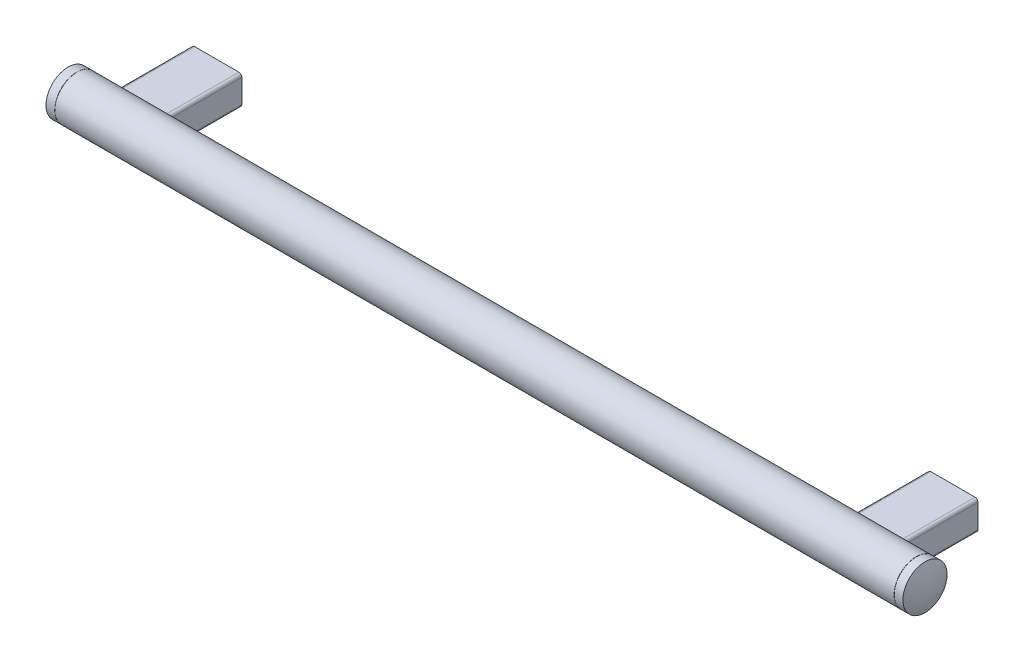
ISO-10303-21;
HEADER;
FILE_DESCRIPTION(('STEP AP214'),'2;1');
FILE_NAME('part.step','',(''),(''),'','','');
FILE_SCHEMA(('AUTOMOTIVE_DESIGN { 1 0 10303 214 1 1 1 1 }'));
ENDSEC;
DATA;
#1=APPLICATION_CONTEXT('core data for automotive mechanical design processes');
#2=APPLICATION_PROTOCOL_DEFINITION('international standard','automotive_design',2000,#1);
#3=PRODUCT_CONTEXT('',#1,'mechanical');
#4=PRODUCT('Part','Part','',(#3));
#5=PRODUCT_RELATED_PRODUCT_CATEGORY('part','',(#4));
#6=PRODUCT_DEFINITION_FORMATION('','',#4);
#7=PRODUCT_DEFINITION_CONTEXT('part definition',#1,'design');
#8=PRODUCT_DEFINITION('design','',#6,#7);
#9=PRODUCT_DEFINITION_SHAPE('','',#8);
#10=(LENGTH_UNIT() NAMED_UNIT(*) SI_UNIT(.MILLI.,.METRE.));
#11=(NAMED_UNIT(*) PLANE_ANGLE_UNIT() SI_UNIT($,.RADIAN.));
#12=(NAMED_UNIT(*) SI_UNIT($,.STERADIAN.) SOLID_ANGLE_UNIT());
#13=UNCERTAINTY_MEASURE_WITH_UNIT(LENGTH_MEASURE(1.E-05),#10,'distance_accuracy_value','');
#14=(GEOMETRIC_REPRESENTATION_CONTEXT(3) GLOBAL_UNCERTAINTY_ASSIGNED_CONTEXT((#13)) GLOBAL_UNIT_ASSIGNED_CONTEXT((#10,
#11,#12)) REPRESENTATION_CONTEXT('',''));
#15=CARTESIAN_POINT('',(0.,0.,0.));
#16=DIRECTION('',(0.,0.,1.));
#17=DIRECTION('',(1.,0.,0.));
#18=AXIS2_PLACEMENT_3D('',#15,#16,#17);
#19=CARTESIAN_POINT('',(0.,0.,17.));
#20=DIRECTION('',(0.,0.,-1.));
#21=DIRECTION('',(0.,1.,0.));
#22=AXIS2_PLACEMENT_3D('',#19,#20,#21);
#23=PLANE('',#22);
#24=CARTESIAN_POINT('',(0.,0.,17.));
#25=DIRECTION('',(0.,0.,-1.));
#26=DIRECTION('',(0.,1.,0.));
#27=AXIS2_PLACEMENT_3D('',#24,#25,#26);
#28=CIRCLE('',#27,3.);
#29=CARTESIAN_POINT('',(0.,3.,17.));
#30=VERTEX_POINT('',#29);
#31=EDGE_CURVE('E209',#30,#30,#28,.T.);
#32=ORIENTED_EDGE('',*,*,#31,.T.);
#33=EDGE_LOOP('',(#32));
#34=FACE_BOUND('',#33,.T.);
#35=ADVANCED_FACE('F14',(#34),#23,.T.);
#36=CARTESIAN_POINT('',(-5.,0.,60.));
#37=DIRECTION('',(1.,0.,0.));
#38=DIRECTION('',(0.,0.,1.));
#39=AXIS2_PLACEMENT_3D('',#36,#37,#38);
#40=SPHERICAL_SURFACE('',#39,39.);
#41=CARTESIAN_POINT('',(-41.,-2.69034686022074E-13,60.));
#42=DIRECTION('',(1.,0.,0.));
#43=DIRECTION('',(0.,1.,0.));
#44=AXIS2_PLACEMENT_3D('',#41,#42,#43);
#45=CIRCLE('',#44,15.);
#46=CARTESIAN_POINT('',(-41.0000000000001,14.9999999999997,60.));
#47=VERTEX_POINT('',#46);
#48=EDGE_CURVE('E322',#47,#47,#45,.T.);
#49=ORIENTED_EDGE('',*,*,#48,.F.);
#50=EDGE_LOOP('',(#49));
#51=FACE_BOUND('',#50,.T.);
#52=ADVANCED_FACE('F16',(#51),#40,.T.);
#53=CARTESIAN_POINT('',(0.,0.,17.));
#54=DIRECTION('',(0.,0.,-1.));
#55=DIRECTION('',(0.,1.,0.));
#56=AXIS2_PLACEMENT_3D('',#53,#54,#55);
#57=CYLINDRICAL_SURFACE('',#56,3.);
#58=ORIENTED_EDGE('',*,*,#31,.F.);
#59=EDGE_LOOP('',(#58));
#60=FACE_BOUND('',#59,.T.);
#61=CARTESIAN_POINT('',(0.,0.,0.));
#62=DIRECTION('',(0.,0.,-1.));
#63=DIRECTION('',(0.,1.,0.));
#64=AXIS2_PLACEMENT_3D('',#61,#62,#63);
#65=CIRCLE('',#64,3.);
#66=CARTESIAN_POINT('',(0.,3.,0.));
#67=VERTEX_POINT('',#66);
#68=EDGE_CURVE('E206',#67,#67,#65,.T.);
#69=ORIENTED_EDGE('',*,*,#68,.T.);
#70=EDGE_LOOP('',(#69));
#71=FACE_BOUND('',#70,.T.);
#72=ADVANCED_FACE('F342',(#60,#71),#57,.F.);
#73=CARTESIAN_POINT('',(-35.,-2.27871649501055E-13,60.));
#74=DIRECTION('',(1.,0.,0.));
#75=DIRECTION('',(0.,1.,0.));
#76=AXIS2_PLACEMENT_3D('',#73,#74,#75);
#77=CYLINDRICAL_SURFACE('',#76,15.);
#78=CARTESIAN_POINT('',(-35.1,-2.28557700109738E-13,60.));
#79=DIRECTION('',(-1.,0.,0.));
#80=DIRECTION('',(0.,-1.,0.));
#81=AXIS2_PLACEMENT_3D('',#78,#79,#80);
#82=CIRCLE('',#81,15.);
#83=CARTESIAN_POINT('',(-35.0999999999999,-15.0000000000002,60.));
#84=VERTEX_POINT('',#83);
#85=EDGE_CURVE('E9',#84,#84,#82,.T.);
#86=ORIENTED_EDGE('',*,*,#85,.T.);
#87=EDGE_LOOP('',(#86));
#88=FACE_BOUND('',#87,.T.);
#89=ORIENTED_EDGE('',*,*,#48,.T.);
#90=EDGE_LOOP('',(#89));
#91=FACE_BOUND('',#90,.T.);
#92=ADVANCED_FACE('F332',(#88,#91),#77,.T.);
#93=CARTESIAN_POINT('',(15.,8.0000000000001,0.));
#94=DIRECTION('',(0.,0.,-1.));
#95=DIRECTION('',(1.,0.,0.));
#96=AXIS2_PLACEMENT_3D('',#93,#94,#95);
#97=PLANE('',#96);
#98=ORIENTED_EDGE('',*,*,#68,.F.);
#99=EDGE_LOOP('',(#98));
#100=FACE_BOUND('',#99,.T.);
#101=CARTESIAN_POINT('',(15.,8.0000000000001,0.));
#102=DIRECTION('',(0.,0.,-1.));
#103=DIRECTION('',(1.,0.,0.));
#104=AXIS2_PLACEMENT_3D('',#101,#102,#103);
#105=CIRCLE('',#104,2.);
#106=CARTESIAN_POINT('',(15.,10.,0.));
#107=VERTEX_POINT('',#106);
#108=CARTESIAN_POINT('',(17.,8.00000000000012,0.));
#109=VERTEX_POINT('',#108);
#110=EDGE_CURVE('E212',#107,#109,#105,.T.);
#111=ORIENTED_EDGE('',*,*,#110,.T.);
#112=DIRECTION('',(0.,-1.,0.));
#113=VECTOR('',#112,1.);
#114=CARTESIAN_POINT('',(17.,8.00000000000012,0.));
#115=LINE('',#114,#113);
#116=CARTESIAN_POINT('',(17.,-7.99999999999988,0.));
#117=VERTEX_POINT('',#116);
#118=EDGE_CURVE('E226',#109,#117,#115,.T.);
#119=ORIENTED_EDGE('',*,*,#118,.T.);
#120=CARTESIAN_POINT('',(15.,-7.9999999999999,0.));
#121=DIRECTION('',(0.,0.,-1.));
#122=DIRECTION('',(1.,0.,0.));
#123=AXIS2_PLACEMENT_3D('',#120,#121,#122);
#124=CIRCLE('',#123,2.);
#125=CARTESIAN_POINT('',(15.,-10.,0.));
#126=VERTEX_POINT('',#125);
#127=EDGE_CURVE('E224',#117,#126,#124,.T.);
#128=ORIENTED_EDGE('',*,*,#127,.T.);
#129=DIRECTION('',(-1.,0.,0.));
#130=VECTOR('',#129,1.);
#131=CARTESIAN_POINT('',(15.,-10.,0.));
#132=LINE('',#131,#130);
#133=CARTESIAN_POINT('',(-15.,-10.,0.));
#134=VERTEX_POINT('',#133);
#135=EDGE_CURVE('E222',#126,#134,#132,.T.);
#136=ORIENTED_EDGE('',*,*,#135,.T.);
#137=CARTESIAN_POINT('',(-15.,-8.0000000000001,0.));
#138=DIRECTION('',(0.,0.,-1.));
#139=DIRECTION('',(1.,0.,0.));
#140=AXIS2_PLACEMENT_3D('',#137,#138,#139);
#141=CIRCLE('',#140,2.);
#142=CARTESIAN_POINT('',(-17.,-8.00000000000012,0.));
#143=VERTEX_POINT('',#142);
#144=EDGE_CURVE('E220',#134,#143,#141,.T.);
#145=ORIENTED_EDGE('',*,*,#144,.T.);
#146=DIRECTION('',(0.,1.,0.));
#147=VECTOR('',#146,1.);
#148=CARTESIAN_POINT('',(-17.,-8.00000000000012,0.));
#149=LINE('',#148,#147);
#150=CARTESIAN_POINT('',(-17.,7.99999999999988,0.));
#151=VERTEX_POINT('',#150);
#152=EDGE_CURVE('E218',#143,#151,#149,.T.);
#153=ORIENTED_EDGE('',*,*,#152,.T.);
#154=CARTESIAN_POINT('',(-15.,7.9999999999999,0.));
#155=DIRECTION('',(0.,0.,-1.));
#156=DIRECTION('',(1.,0.,0.));
#157=AXIS2_PLACEMENT_3D('',#154,#155,#156);
#158=CIRCLE('',#157,2.);
#159=CARTESIAN_POINT('',(-15.,10.,0.));
#160=VERTEX_POINT('',#159);
#161=EDGE_CURVE('E216',#151,#160,#158,.T.);
#162=ORIENTED_EDGE('',*,*,#161,.T.);
#163=DIRECTION('',(1.,0.,0.));
#164=VECTOR('',#163,1.);
#165=CARTESIAN_POINT('',(-15.,10.,0.));
#166=LINE('',#165,#164);
#167=EDGE_CURVE('E213',#160,#107,#166,.T.);
#168=ORIENTED_EDGE('',*,*,#167,.T.);
#169=EDGE_LOOP('',(#111,#119,#128,#136,#145,#153,#162,#168));
#170=FACE_BOUND('',#169,.T.);
#171=ADVANCED_FACE('F330',(#100,#170),#97,.T.);
#172=CARTESIAN_POINT('',(-35.,-2.27871649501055E-13,60.));
#173=DIRECTION('',(-1.,0.,0.));
#174=DIRECTION('',(0.,-1.,0.));
#175=AXIS2_PLACEMENT_3D('',#172,#173,#174);
#176=CONICAL_SURFACE('',#175,14.9,0.785398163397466);
#177=ORIENTED_EDGE('',*,*,#85,.F.);
#178=EDGE_LOOP('',(#177));
#179=FACE_BOUND('',#178,.T.);
#180=CARTESIAN_POINT('',(-35.,-2.27871649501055E-13,60.));
#181=DIRECTION('',(-1.,0.,0.));
#182=DIRECTION('',(0.,-1.,0.));
#183=AXIS2_PLACEMENT_3D('',#180,#181,#182);
#184=CIRCLE('',#183,14.9);
#185=CARTESIAN_POINT('',(-34.9999999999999,-14.9000000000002,60.));
#186=VERTEX_POINT('',#185);
#187=EDGE_CURVE('E22',#186,#186,#184,.F.);
#188=ORIENTED_EDGE('',*,*,#187,.F.);
#189=EDGE_LOOP('',(#188));
#190=FACE_BOUND('',#189,.T.);
#191=ADVANCED_FACE('F308',(#179,#190),#176,.T.);
#192=CARTESIAN_POINT('',(15.,-7.9999999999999,0.));
#193=DIRECTION('',(0.,0.,1.));
#194=DIRECTION('',(-1.,0.,0.));
#195=AXIS2_PLACEMENT_3D('',#192,#193,#194);
#196=CYLINDRICAL_SURFACE('',#195,2.);
#197=CARTESIAN_POINT('',(13.,-7.99999999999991,47.3114224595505));
#198=CARTESIAN_POINT('',(13.0000023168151,-8.14386139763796,47.4021308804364));
#199=CARTESIAN_POINT('',(13.0155259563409,-8.28625788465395,47.4953643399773));
#200=CARTESIAN_POINT('',(13.0758229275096,-8.56371074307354,47.6837058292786));
#201=CARTESIAN_POINT('',(13.1206564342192,-8.69875139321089,47.7788173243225));
#202=CARTESIAN_POINT('',(13.2349554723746,-8.95003632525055,47.9617438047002));
#203=CARTESIAN_POINT('',(13.3028588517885,-9.06691465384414,48.0496641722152));
#204=CARTESIAN_POINT('',(13.4631357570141,-9.28706267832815,48.2199435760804));
#205=CARTESIAN_POINT('',(13.5554607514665,-9.39035876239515,48.3023132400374));
#206=CARTESIAN_POINT('',(13.7336841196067,-9.55123394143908,48.4336095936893));
#207=CARTESIAN_POINT('',(13.8135167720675,-9.6133331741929,48.4852566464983));
#208=CARTESIAN_POINT('',(13.9850088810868,-9.72635405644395,48.5805658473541));
#209=CARTESIAN_POINT('',(14.0766503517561,-9.77729239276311,48.624239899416));
#210=CARTESIAN_POINT('',(14.2529034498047,-9.85726234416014,48.6935123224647));
#211=CARTESIAN_POINT('',(14.3357376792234,-9.88859638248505,48.720955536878));
#212=CARTESIAN_POINT('',(14.507188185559,-9.94039558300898,48.766579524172));
#213=CARTESIAN_POINT('',(14.5958003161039,-9.96086844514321,48.7847668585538));
#214=CARTESIAN_POINT('',(14.7770635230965,-9.98966321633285,48.8104058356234));
#215=CARTESIAN_POINT('',(14.8697344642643,-9.9979163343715,48.8177966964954));
#216=CARTESIAN_POINT('',(15.0555138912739,-10.0013851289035,48.8208987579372));
#217=CARTESIAN_POINT('',(15.1486222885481,-9.99660333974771,48.8166122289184));
#218=CARTESIAN_POINT('',(15.3236977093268,-9.97542143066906,48.7977175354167));
#219=CARTESIAN_POINT('',(15.4059092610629,-9.96011451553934,48.7840808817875));
#220=CARTESIAN_POINT('',(15.5660895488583,-9.91999093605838,48.7485782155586));
#221=CARTESIAN_POINT('',(15.6440574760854,-9.89517246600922,48.7267106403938));
#222=CARTESIAN_POINT('',(15.7999821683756,-9.83508027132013,48.674237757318));
#223=CARTESIAN_POINT('',(15.8775130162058,-9.79916985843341,48.6431064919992));
#224=CARTESIAN_POINT('',(16.0253011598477,-9.71925283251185,48.5746377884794));
#225=CARTESIAN_POINT('',(16.0955525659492,-9.67523974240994,48.5372953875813));
#226=CARTESIAN_POINT('',(16.2620749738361,-9.55636990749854,48.4378021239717));
#227=CARTESIAN_POINT('',(16.353495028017,-9.47718432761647,48.3726678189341));
#228=CARTESIAN_POINT('',(16.518627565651,-9.30686163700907,48.2358889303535));
#229=CARTESIAN_POINT('',(16.5923103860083,-9.21570489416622,48.1642337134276));
#230=CARTESIAN_POINT('',(16.7227715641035,-9.02265032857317,48.0163959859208));
#231=CARTESIAN_POINT('',(16.7792895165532,-8.9206160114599,47.940162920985));
#232=CARTESIAN_POINT('',(16.8736458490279,-8.70912728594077,47.7865564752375));
#233=CARTESIAN_POINT('',(16.9114866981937,-8.5996738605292,47.7091832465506));
#234=CARTESIAN_POINT('',(16.9722292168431,-8.35796248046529,47.543311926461));
#235=CARTESIAN_POINT('',(16.9919212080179,-8.22479320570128,47.4549411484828));
#236=CARTESIAN_POINT('',(17.0040509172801,-7.95466925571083,47.2819435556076));
#237=CARTESIAN_POINT('',(16.9964773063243,-7.81771303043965,47.1973183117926));
#238=CARTESIAN_POINT('',(16.9529013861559,-7.5479211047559,47.0364770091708));
#239=CARTESIAN_POINT('',(16.9176078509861,-7.4150673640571,46.960104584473));
#240=CARTESIAN_POINT('',(16.8182830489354,-7.15555538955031,46.8159187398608));
#241=CARTESIAN_POINT('',(16.7542827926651,-7.02889063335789,46.7480961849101));
#242=CARTESIAN_POINT('',(16.6077870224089,-6.80389422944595,46.631341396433));
#243=CARTESIAN_POINT('',(16.5287203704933,-6.70401274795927,46.5811018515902));
#244=CARTESIAN_POINT('',(16.3502883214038,-6.51906286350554,46.4902837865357));
#245=CARTESIAN_POINT('',(16.2509443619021,-6.43397899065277,46.449695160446));
#246=CARTESIAN_POINT('',(16.0496639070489,-6.29378739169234,46.3840743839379));
#247=CARTESIAN_POINT('',(15.9499072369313,-6.23617899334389,46.3576788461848));
#248=CARTESIAN_POINT('',(15.7404007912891,-6.13851290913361,46.3134536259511));
#249=CARTESIAN_POINT('',(15.6306571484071,-6.09844453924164,46.2956187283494));
#250=CARTESIAN_POINT('',(15.4147576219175,-6.04056991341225,46.2700171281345));
#251=CARTESIAN_POINT('',(15.3091262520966,-6.0211242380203,46.2615068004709));
#252=CARTESIAN_POINT('',(15.0957874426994,-5.99942292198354,46.2520156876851));
#253=CARTESIAN_POINT('',(14.9880805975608,-5.99716243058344,46.2510327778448));
#254=CARTESIAN_POINT('',(14.7777746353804,-6.00969461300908,46.2565067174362));
#255=CARTESIAN_POINT('',(14.6751312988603,-6.02387585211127,46.2626968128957));
#256=CARTESIAN_POINT('',(14.4738867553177,-6.06769355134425,46.281994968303));
#257=CARTESIAN_POINT('',(14.3752853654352,-6.09732931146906,46.2951027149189));
#258=CARTESIAN_POINT('',(14.1842523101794,-6.1710398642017,46.3281349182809));
#259=CARTESIAN_POINT('',(14.0918564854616,-6.21519107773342,46.3480954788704));
#260=CARTESIAN_POINT('',(13.9160688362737,-6.3161436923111,46.3945082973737));
#261=CARTESIAN_POINT('',(13.8326780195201,-6.37294650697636,46.4209612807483));
#262=CARTESIAN_POINT('',(13.6732429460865,-6.49982014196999,46.481218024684));
#263=CARTESIAN_POINT('',(13.5976745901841,-6.57035979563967,46.5152909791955));
#264=CARTESIAN_POINT('',(13.4595254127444,-6.72041002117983,46.5894410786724));
#265=CARTESIAN_POINT('',(13.3969495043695,-6.79992396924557,46.6295204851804));
#266=CARTESIAN_POINT('',(13.2808729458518,-6.97225102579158,46.7185142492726));
#267=CARTESIAN_POINT('',(13.2285510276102,-7.06562015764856,46.7678851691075));
#268=CARTESIAN_POINT('',(13.1401606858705,-7.25695759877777,46.8718461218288));
#269=CARTESIAN_POINT('',(13.1040923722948,-7.35492593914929,46.9264361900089));
#270=CARTESIAN_POINT('',(13.0503538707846,-7.54425766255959,47.0348536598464));
#271=CARTESIAN_POINT('',(13.0313508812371,-7.63544968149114,47.08833048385));
#272=CARTESIAN_POINT('',(13.0061708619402,-7.81795534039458,47.1980102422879));
#273=CARTESIAN_POINT('',(12.9999985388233,-7.90926901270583,47.2542141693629));
#274=CARTESIAN_POINT('',(13.,-7.99999999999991,47.3114224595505));
#275=B_SPLINE_CURVE_WITH_KNOTS('',3,(#197,#198,#199,#200,#201,#202,#203,#204,#205,#206,#207,
#208,#209,#210,#211,#212,#213,#214,#215,#216,#217,#218,#219,#220,#221,#222,#223,#224,#225,#226,
#227,#228,#229,#230,#231,#232,#233,#234,#235,#236,#237,#238,#239,#240,#241,#242,#243,#244,#245,
#246,#247,#248,#249,#250,#251,#252,#253,#254,#255,#256,#257,#258,#259,#260,#261,#262,#263,#264,
#265,#266,#267,#268,#269,#270,#271,#272,#273,#274),.UNSPECIFIED.,.T.,.F.,(4,2,2,2,2,2,2,2,2,2,2,
2,2,2,2,2,2,2,2,2,2,2,2,2,2,2,2,2,2,2,2,2,2,2,2,2,2,2,4),(0.,0.50977099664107,1.02059188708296,
1.50208208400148,1.98262254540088,2.32213593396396,2.66113819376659,2.93816857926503,
3.21500230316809,3.4933886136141,3.77172080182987,4.02480636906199,4.27794000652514,
4.54976470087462,4.82180763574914,5.23168501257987,5.6422431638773,6.05875006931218,
6.47520189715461,6.95596901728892,7.43693592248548,7.90599013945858,8.37453887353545,
8.78294034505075,9.19091226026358,9.54354102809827,9.89595470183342,10.2175724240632,
10.5390993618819,10.8490427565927,11.1589721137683,11.4705600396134,11.7821827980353,
12.1073297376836,12.4325994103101,12.7847727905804,13.1369485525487,13.4583347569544,
13.7798388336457),.UNSPECIFIED.);
#276=CARTESIAN_POINT('',(15.,-10.,48.819660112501));
#277=VERTEX_POINT('',#276);
#278=CARTESIAN_POINT('',(17.,-7.99999999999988,47.3114224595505));
#279=VERTEX_POINT('',#278);
#280=EDGE_CURVE('E296',#277,#279,#275,.T.);
#281=ORIENTED_EDGE('',*,*,#280,.F.);
#282=DIRECTION('',(0.,0.,1.));
#283=VECTOR('',#282,1.);
#284=CARTESIAN_POINT('',(15.,-10.,0.));
#285=LINE('',#284,#283);
#286=EDGE_CURVE('E236',#126,#277,#285,.T.);
#287=ORIENTED_EDGE('',*,*,#286,.F.);
#288=ORIENTED_EDGE('',*,*,#127,.F.);
#289=DIRECTION('',(0.,0.,1.));
#290=VECTOR('',#289,1.);
#291=CARTESIAN_POINT('',(17.,-7.99999999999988,0.));
#292=LINE('',#291,#290);
#293=EDGE_CURVE('E233',#117,#279,#292,.T.);
#294=ORIENTED_EDGE('',*,*,#293,.T.);
#295=EDGE_LOOP('',(#281,#287,#288,#294));
#296=FACE_BOUND('',#295,.T.);
#297=ADVANCED_FACE('F304',(#296),#196,.T.);
#298=CARTESIAN_POINT('',(15.,-10.,0.));
#299=DIRECTION('',(0.,1.,0.));
#300=DIRECTION('',(1.,0.,0.));
#301=AXIS2_PLACEMENT_3D('',#298,#299,#300);
#302=PLANE('',#301);
#303=DIRECTION('',(1.,0.,0.));
#304=VECTOR('',#303,1.);
#305=CARTESIAN_POINT('',(-35.,-10.0000000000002,48.819660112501));
#306=LINE('',#305,#304);
#307=CARTESIAN_POINT('',(-15.,-10.,48.8196601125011));
#308=VERTEX_POINT('',#307);
#309=EDGE_CURVE('E293',#308,#277,#306,.T.);
#310=ORIENTED_EDGE('',*,*,#309,.F.);
#311=DIRECTION('',(0.,0.,1.));
#312=VECTOR('',#311,1.);
#313=CARTESIAN_POINT('',(-15.,-10.,0.));
#314=LINE('',#313,#312);
#315=EDGE_CURVE('E239',#134,#308,#314,.T.);
#316=ORIENTED_EDGE('',*,*,#315,.F.);
#317=ORIENTED_EDGE('',*,*,#135,.F.);
#318=ORIENTED_EDGE('',*,*,#286,.T.);
#319=EDGE_LOOP('',(#310,#316,#317,#318));
#320=FACE_BOUND('',#319,.T.);
#321=ADVANCED_FACE('F284',(#320),#302,.F.);
#322=CARTESIAN_POINT('',(-15.,-8.0000000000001,0.));
#323=DIRECTION('',(0.,0.,1.));
#324=DIRECTION('',(-1.,0.,0.));
#325=AXIS2_PLACEMENT_3D('',#322,#323,#324);
#326=CYLINDRICAL_SURFACE('',#325,2.);
#327=CARTESIAN_POINT('',(-17.,-8.00000000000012,47.3114224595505));
#328=CARTESIAN_POINT('',(-16.9999976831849,-8.14386139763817,47.4021308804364));
#329=CARTESIAN_POINT('',(-16.9844740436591,-8.28625788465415,47.4953643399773));
#330=CARTESIAN_POINT('',(-16.9241770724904,-8.56371074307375,47.6837058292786));
#331=CARTESIAN_POINT('',(-16.8793435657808,-8.69875139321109,47.7788173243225));
#332=CARTESIAN_POINT('',(-16.7650445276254,-8.95003632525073,47.9617438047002));
#333=CARTESIAN_POINT('',(-16.6971411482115,-9.06691465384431,48.0496641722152));
#334=CARTESIAN_POINT('',(-16.5368642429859,-9.28706267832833,48.2199435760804));
#335=CARTESIAN_POINT('',(-16.4445392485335,-9.39035876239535,48.3023132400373));
#336=CARTESIAN_POINT('',(-16.2663158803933,-9.55123394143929,48.4336095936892));
#337=CARTESIAN_POINT('',(-16.1864832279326,-9.61333317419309,48.4852566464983));
#338=CARTESIAN_POINT('',(-16.0149911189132,-9.72635405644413,48.5805658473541));
#339=CARTESIAN_POINT('',(-15.9233496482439,-9.77729239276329,48.624239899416));
#340=CARTESIAN_POINT('',(-15.7470965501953,-9.85726234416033,48.6935123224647));
#341=CARTESIAN_POINT('',(-15.6642623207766,-9.88859638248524,48.720955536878));
#342=CARTESIAN_POINT('',(-15.492811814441,-9.94039558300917,48.7665795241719));
#343=CARTESIAN_POINT('',(-15.4041996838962,-9.96086844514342,48.7847668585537));
#344=CARTESIAN_POINT('',(-15.2229364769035,-9.98966321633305,48.8104058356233));
#345=CARTESIAN_POINT('',(-15.1302655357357,-9.9979163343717,48.8177966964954));
#346=CARTESIAN_POINT('',(-14.9444861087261,-10.0013851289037,48.8208987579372));
#347=CARTESIAN_POINT('',(-14.8513777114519,-9.99660333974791,48.8166122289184));
#348=CARTESIAN_POINT('',(-14.6763022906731,-9.97542143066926,48.7977175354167));
#349=CARTESIAN_POINT('',(-14.5940907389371,-9.96011451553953,48.7840808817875));
#350=CARTESIAN_POINT('',(-14.4339104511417,-9.91999093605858,48.7485782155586));
#351=CARTESIAN_POINT('',(-14.3559425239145,-9.89517246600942,48.7267106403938));
#352=CARTESIAN_POINT('',(-14.2000178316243,-9.83508027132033,48.674237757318));
#353=CARTESIAN_POINT('',(-14.1224869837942,-9.7991698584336,48.6431064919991));
#354=CARTESIAN_POINT('',(-13.9746988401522,-9.71925283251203,48.5746377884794));
#355=CARTESIAN_POINT('',(-13.9044474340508,-9.67523974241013,48.5372953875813));
#356=CARTESIAN_POINT('',(-13.7379250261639,-9.55636990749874,48.4378021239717));
#357=CARTESIAN_POINT('',(-13.646504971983,-9.47718432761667,48.3726678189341));
#358=CARTESIAN_POINT('',(-13.481372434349,-9.30686163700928,48.2358889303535));
#359=CARTESIAN_POINT('',(-13.4076896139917,-9.21570489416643,48.1642337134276));
#360=CARTESIAN_POINT('',(-13.2772284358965,-9.02265032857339,48.0163959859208));
#361=CARTESIAN_POINT('',(-13.2207104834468,-8.92061601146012,47.9401629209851));
#362=CARTESIAN_POINT('',(-13.1263541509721,-8.70912728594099,47.7865564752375));
#363=CARTESIAN_POINT('',(-13.0885133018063,-8.59967386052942,47.7091832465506));
#364=CARTESIAN_POINT('',(-13.0277707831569,-8.35796248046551,47.543311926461));
#365=CARTESIAN_POINT('',(-13.0080787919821,-8.2247932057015,47.4549411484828));
#366=CARTESIAN_POINT('',(-12.9959490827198,-7.95466925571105,47.2819435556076));
#367=CARTESIAN_POINT('',(-13.0035226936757,-7.81771303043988,47.1973183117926));
#368=CARTESIAN_POINT('',(-13.0470986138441,-7.54792110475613,47.0364770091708));
#369=CARTESIAN_POINT('',(-13.0823921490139,-7.41506736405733,46.960104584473));
#370=CARTESIAN_POINT('',(-13.1817169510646,-7.15555538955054,46.8159187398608));
#371=CARTESIAN_POINT('',(-13.2457172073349,-7.02889063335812,46.7480961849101));
#372=CARTESIAN_POINT('',(-13.392212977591,-6.80389422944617,46.631341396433));
#373=CARTESIAN_POINT('',(-13.4712796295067,-6.70401274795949,46.5811018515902));
#374=CARTESIAN_POINT('',(-13.6497116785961,-6.51906286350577,46.4902837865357));
#375=CARTESIAN_POINT('',(-13.7490556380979,-6.433978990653,46.449695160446));
#376=CARTESIAN_POINT('',(-13.950336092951,-6.29378739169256,46.3840743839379));
#377=CARTESIAN_POINT('',(-14.0500927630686,-6.23617899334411,46.3576788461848));
#378=CARTESIAN_POINT('',(-14.2595992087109,-6.13851290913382,46.3134536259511));
#379=CARTESIAN_POINT('',(-14.3693428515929,-6.09844453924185,46.2956187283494));
#380=CARTESIAN_POINT('',(-14.5852423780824,-6.04056991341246,46.2700171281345));
#381=CARTESIAN_POINT('',(-14.6908737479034,-6.02112423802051,46.2615068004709));
#382=CARTESIAN_POINT('',(-14.9042125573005,-5.99942292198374,46.2520156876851));
#383=CARTESIAN_POINT('',(-15.0119194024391,-5.99716243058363,46.2510327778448));
#384=CARTESIAN_POINT('',(-15.2222253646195,-6.00969461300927,46.2565067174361));
#385=CARTESIAN_POINT('',(-15.3248687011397,-6.02387585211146,46.2626968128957));
#386=CARTESIAN_POINT('',(-15.5261132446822,-6.06769355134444,46.281994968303));
#387=CARTESIAN_POINT('',(-15.6247146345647,-6.09732931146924,46.2951027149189));
#388=CARTESIAN_POINT('',(-15.8157476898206,-6.17103986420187,46.3281349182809));
#389=CARTESIAN_POINT('',(-15.9081435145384,-6.21519107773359,46.3480954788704));
#390=CARTESIAN_POINT('',(-16.0839311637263,-6.31614369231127,46.3945082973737));
#391=CARTESIAN_POINT('',(-16.1673219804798,-6.37294650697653,46.4209612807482));
#392=CARTESIAN_POINT('',(-16.3267570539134,-6.49982014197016,46.4812180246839));
#393=CARTESIAN_POINT('',(-16.4023254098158,-6.57035979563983,46.5152909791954));
#394=CARTESIAN_POINT('',(-16.5404745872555,-6.72041002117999,46.5894410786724));
#395=CARTESIAN_POINT('',(-16.6030504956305,-6.79992396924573,46.6295204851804));
#396=CARTESIAN_POINT('',(-16.7191270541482,-6.97225102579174,46.7185142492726));
#397=CARTESIAN_POINT('',(-16.7714489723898,-7.06562015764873,46.7678851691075));
#398=CARTESIAN_POINT('',(-16.8598393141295,-7.25695759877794,46.8718461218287));
#399=CARTESIAN_POINT('',(-16.8959076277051,-7.35492593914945,46.9264361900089));
#400=CARTESIAN_POINT('',(-16.9496461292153,-7.54425766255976,47.0348536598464));
#401=CARTESIAN_POINT('',(-16.9686491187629,-7.63544968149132,47.08833048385));
#402=CARTESIAN_POINT('',(-16.9938291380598,-7.81795534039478,47.1980102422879));
#403=CARTESIAN_POINT('',(-17.0000014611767,-7.90926901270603,47.2542141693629));
#404=CARTESIAN_POINT('',(-17.,-8.00000000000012,47.3114224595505));
#405=B_SPLINE_CURVE_WITH_KNOTS('',3,(#327,#328,#329,#330,#331,#332,#333,#334,#335,#336,#337,
#338,#339,#340,#341,#342,#343,#344,#345,#346,#347,#348,#349,#350,#351,#352,#353,#354,#355,#356,
#357,#358,#359,#360,#361,#362,#363,#364,#365,#366,#367,#368,#369,#370,#371,#372,#373,#374,#375,
#376,#377,#378,#379,#380,#381,#382,#383,#384,#385,#386,#387,#388,#389,#390,#391,#392,#393,#394,
#395,#396,#397,#398,#399,#400,#401,#402,#403,#404),.UNSPECIFIED.,.T.,.F.,(4,2,2,2,2,2,2,2,2,2,2,
2,2,2,2,2,2,2,2,2,2,2,2,2,2,2,2,2,2,2,2,2,2,2,2,2,2,2,4),(0.,0.509770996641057,1.02059188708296,
1.50208208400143,1.98262254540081,2.32213593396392,2.66113819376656,2.93816857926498,
3.21500230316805,3.49338861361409,3.77172080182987,4.024806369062,4.27794000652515,
4.54976470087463,4.82180763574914,5.23168501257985,5.64224316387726,6.05875006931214,
6.47520189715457,6.95596901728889,7.43693592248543,7.90599013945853,8.37453887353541,
8.78294034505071,9.19091226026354,9.54354102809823,9.89595470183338,10.2175724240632,
10.5390993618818,10.8490427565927,11.1589721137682,11.4705600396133,11.7821827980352,
12.1073297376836,12.4325994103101,12.7847727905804,13.1369485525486,13.4583347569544,
13.7798388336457),.UNSPECIFIED.);
#406=CARTESIAN_POINT('',(-17.,-8.00000000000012,47.3114224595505));
#407=VERTEX_POINT('',#406);
#408=EDGE_CURVE('E287',#407,#308,#405,.T.);
#409=ORIENTED_EDGE('',*,*,#408,.F.);
#410=DIRECTION('',(0.,0.,1.));
#411=VECTOR('',#410,1.);
#412=CARTESIAN_POINT('',(-17.,-8.00000000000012,0.));
#413=LINE('',#412,#411);
#414=EDGE_CURVE('E242',#143,#407,#413,.T.);
#415=ORIENTED_EDGE('',*,*,#414,.F.);
#416=ORIENTED_EDGE('',*,*,#144,.F.);
#417=ORIENTED_EDGE('',*,*,#315,.T.);
#418=EDGE_LOOP('',(#409,#415,#416,#417));
#419=FACE_BOUND('',#418,.T.);
#420=ADVANCED_FACE('F279',(#419),#326,.T.);
#421=CARTESIAN_POINT('',(-17.,-8.00000000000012,0.));
#422=DIRECTION('',(1.,0.,0.));
#423=DIRECTION('',(0.,0.,1.));
#424=AXIS2_PLACEMENT_3D('',#421,#422,#423);
#425=PLANE('',#424);
#426=CARTESIAN_POINT('',(-17.,-1.18710434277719E-13,60.));
#427=DIRECTION('',(1.,0.,0.));
#428=DIRECTION('',(0.,0.,1.));
#429=AXIS2_PLACEMENT_3D('',#426,#427,#428);
#430=CIRCLE('',#429,15.);
#431=CARTESIAN_POINT('',(-17.,7.99999999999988,47.3114224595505));
#432=VERTEX_POINT('',#431);
#433=EDGE_CURVE('E263',#432,#407,#430,.F.);
#434=ORIENTED_EDGE('',*,*,#433,.F.);
#435=DIRECTION('',(0.,0.,1.));
#436=VECTOR('',#435,1.);
#437=CARTESIAN_POINT('',(-17.,7.99999999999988,0.));
#438=LINE('',#437,#436);
#439=EDGE_CURVE('E245',#151,#432,#438,.T.);
#440=ORIENTED_EDGE('',*,*,#439,.F.);
#441=ORIENTED_EDGE('',*,*,#152,.F.);
#442=ORIENTED_EDGE('',*,*,#414,.T.);
#443=EDGE_LOOP('',(#434,#440,#441,#442));
#444=FACE_BOUND('',#443,.T.);
#445=ADVANCED_FACE('F274',(#444),#425,.F.);
#446=CARTESIAN_POINT('',(-15.,7.9999999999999,0.));
#447=DIRECTION('',(0.,0.,1.));
#448=DIRECTION('',(-1.,0.,0.));
#449=AXIS2_PLACEMENT_3D('',#446,#447,#448);
#450=CYLINDRICAL_SURFACE('',#449,2.);
#451=CARTESIAN_POINT('',(-17.,7.99999999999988,47.3114224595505));
#452=CARTESIAN_POINT('',(-16.9999991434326,7.87909476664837,47.2351918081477));
#453=CARTESIAN_POINT('',(-16.9890388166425,7.75708923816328,47.1607041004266));
#454=CARTESIAN_POINT('',(-16.944013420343,7.51414460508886,47.0170299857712));
#455=CARTESIAN_POINT('',(-16.909954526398,7.39320522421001,46.9478421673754));
#456=CARTESIAN_POINT('',(-16.8175938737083,7.15580080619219,46.8161820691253));
#457=CARTESIAN_POINT('',(-16.7591388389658,7.03936923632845,46.7537554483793));
#458=CARTESIAN_POINT('',(-16.6180104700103,6.81706769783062,46.6379910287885));
#459=CARTESIAN_POINT('',(-16.5353548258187,6.71119009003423,46.5846466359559));
#460=CARTESIAN_POINT('',(-16.3589136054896,6.52774525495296,46.4945296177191));
#461=CARTESIAN_POINT('',(-16.2677073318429,6.44830074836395,46.4565302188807));
#462=CARTESIAN_POINT('',(-16.0701948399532,6.30605393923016,46.3897143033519));
#463=CARTESIAN_POINT('',(-15.9639012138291,6.24323788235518,46.3608901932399));
#464=CARTESIAN_POINT('',(-15.7525224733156,6.14371866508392,46.3157983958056));
#465=CARTESIAN_POINT('',(-15.6486727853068,6.10485920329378,46.298476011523));
#466=CARTESIAN_POINT('',(-15.4350253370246,6.04473842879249,46.2718452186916));
#467=CARTESIAN_POINT('',(-15.3252301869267,6.02346945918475,46.2625333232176));
#468=CARTESIAN_POINT('',(-15.1101174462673,6.00028628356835,46.2523925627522));
#469=CARTESIAN_POINT('',(-15.0049409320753,5.99726003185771,46.2510762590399));
#470=CARTESIAN_POINT('',(-14.795579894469,6.00771705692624,46.2556422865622));
#471=CARTESIAN_POINT('',(-14.6913952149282,6.02119769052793,46.2615234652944));
#472=CARTESIAN_POINT('',(-14.4886277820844,6.06374928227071,46.2802526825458));
#473=CARTESIAN_POINT('',(-14.3899832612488,6.09257556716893,46.2929914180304));
#474=CARTESIAN_POINT('',(-14.1992155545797,6.16447906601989,46.3251786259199));
#475=CARTESIAN_POINT('',(-14.1070926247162,6.20755683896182,46.3446273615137));
#476=CARTESIAN_POINT('',(-13.9295504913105,6.30744168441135,46.3904718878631));
#477=CARTESIAN_POINT('',(-13.8443382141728,6.36454602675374,46.417019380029));
#478=CARTESIAN_POINT('',(-13.6849200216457,6.48975291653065,46.4763947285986));
#479=CARTESIAN_POINT('',(-13.6107163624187,6.55785771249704,46.5092238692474));
#480=CARTESIAN_POINT('',(-13.4703450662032,6.7072135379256,46.5828236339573));
#481=CARTESIAN_POINT('',(-13.4049591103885,6.78901734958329,46.6239600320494));
#482=CARTESIAN_POINT('',(-13.288789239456,6.95960528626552,46.7119184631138));
#483=CARTESIAN_POINT('',(-13.2380106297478,7.04839193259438,46.7587425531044));
#484=CARTESIAN_POINT('',(-13.146904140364,7.23951560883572,46.8621785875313));
#485=CARTESIAN_POINT('',(-13.1081365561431,7.34231828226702,46.9193012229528));
#486=CARTESIAN_POINT('',(-13.0482089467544,7.55028832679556,47.0382283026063));
#487=CARTESIAN_POINT('',(-13.0270567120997,7.65545672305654,47.1000348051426));
#488=CARTESIAN_POINT('',(-13.0000866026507,7.87914859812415,47.2352758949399));
#489=CARTESIAN_POINT('',(-12.9965732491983,7.9976616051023,47.309187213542));
#490=CARTESIAN_POINT('',(-13.0100119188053,8.23176813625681,47.459768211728));
#491=CARTESIAN_POINT('',(-13.026978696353,8.34735949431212,47.5364398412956));
#492=CARTESIAN_POINT('',(-13.0835973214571,8.5867568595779,47.6999585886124));
#493=CARTESIAN_POINT('',(-13.1257113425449,8.70990049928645,47.786929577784));
#494=CARTESIAN_POINT('',(-13.2334577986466,8.9467076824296,47.9593245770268));
#495=CARTESIAN_POINT('',(-13.2990930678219,9.06037008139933,48.0447483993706));
#496=CARTESIAN_POINT('',(-13.4423655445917,9.25960123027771,48.1985889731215));
#497=CARTESIAN_POINT('',(-13.5169227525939,9.34685994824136,48.2676856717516));
#498=CARTESIAN_POINT('',(-13.6829377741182,9.50957472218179,48.3991861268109));
#499=CARTESIAN_POINT('',(-13.7743716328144,9.58504723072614,48.4615991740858));
#500=CARTESIAN_POINT('',(-13.9509067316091,9.70530243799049,48.5627005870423));
#501=CARTESIAN_POINT('',(-14.0326722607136,9.75315622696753,48.603550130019));
#502=CARTESIAN_POINT('',(-14.2053049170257,9.83784302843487,48.6765742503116));
#503=CARTESIAN_POINT('',(-14.296160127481,9.87469022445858,48.7087599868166));
#504=CARTESIAN_POINT('',(-14.4712701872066,9.9306990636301,48.758007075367));
#505=CARTESIAN_POINT('',(-14.554509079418,9.95167197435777,48.7766025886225));
#506=CARTESIAN_POINT('',(-14.7245244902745,9.98281750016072,48.8042955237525));
#507=CARTESIAN_POINT('',(-14.8112988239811,9.99299668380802,48.8133987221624));
#508=CARTESIAN_POINT('',(-14.9861247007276,10.0018703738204,48.8213315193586));
#509=CARTESIAN_POINT('',(-15.0741788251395,10.0005370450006,48.8201362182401));
#510=CARTESIAN_POINT('',(-15.2486141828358,9.98641726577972,48.8075224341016));
#511=CARTESIAN_POINT('',(-15.3349950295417,9.97362820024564,48.7961016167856));
#512=CARTESIAN_POINT('',(-15.5009447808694,9.93804813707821,48.7645323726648));
#513=CARTESIAN_POINT('',(-15.5806434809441,9.91559258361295,48.7446769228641));
#514=CARTESIAN_POINT('',(-15.7347280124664,9.86194601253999,48.6976421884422));
#515=CARTESIAN_POINT('',(-15.8091112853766,9.83075082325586,48.6704594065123));
#516=CARTESIAN_POINT('',(-15.9806238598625,9.74666189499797,48.5979492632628));
#517=CARTESIAN_POINT('',(-16.0747398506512,9.69009939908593,48.5497345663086));
#518=CARTESIAN_POINT('',(-16.2497262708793,9.56518206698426,48.4451760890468));
#519=CARTESIAN_POINT('',(-16.3305694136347,9.49680351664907,48.3888159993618));
#520=CARTESIAN_POINT('',(-16.497930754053,9.331678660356,48.2554817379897));
#521=CARTESIAN_POINT('',(-16.5804869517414,9.23217372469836,48.1769512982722));
#522=CARTESIAN_POINT('',(-16.7240153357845,9.02177052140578,48.0156229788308));
#523=CARTESIAN_POINT('',(-16.7849693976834,8.9108627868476,47.932821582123));
#524=CARTESIAN_POINT('',(-16.8890292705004,8.67085776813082,47.7590885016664));
#525=CARTESIAN_POINT('',(-16.9302441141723,8.54101472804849,47.6680503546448));
#526=CARTESIAN_POINT('',(-16.9857218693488,8.27458961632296,47.4877259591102));
#527=CARTESIAN_POINT('',(-17.0000009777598,8.13801164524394,47.3984386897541));
#528=CARTESIAN_POINT('',(-17.,7.99999999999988,47.3114224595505));
#529=B_SPLINE_CURVE_WITH_KNOTS('',3,(#451,#452,#453,#454,#455,#456,#457,#458,#459,#460,#461,
#462,#463,#464,#465,#466,#467,#468,#469,#470,#471,#472,#473,#474,#475,#476,#477,#478,#479,#480,
#481,#482,#483,#484,#485,#486,#487,#488,#489,#490,#491,#492,#493,#494,#495,#496,#497,#498,#499,
#500,#501,#502,#503,#504,#505,#506,#507,#508,#509,#510,#511,#512,#513,#514,#515,#516,#517,#518,
#519,#520,#521,#522,#523,#524,#525,#526,#527,#528),.UNSPECIFIED.,.T.,.F.,(4,2,2,2,2,2,2,2,2,2,2,
2,2,2,2,2,2,2,2,2,2,2,2,2,2,2,2,2,2,2,2,2,2,2,2,2,2,2,4),(0.,0.428302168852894,
0.856489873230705,1.28740928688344,1.71801449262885,2.09620696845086,2.47408563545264,
2.80902084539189,3.14381018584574,3.45796652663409,3.77207256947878,4.08131419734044,
4.39056795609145,4.70704747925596,5.02359177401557,5.35972890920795,5.69598797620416,
6.06599418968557,6.43616395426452,6.85362917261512,7.27139532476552,7.73894100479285,
8.206543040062,8.60695107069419,9.00679507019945,9.31517612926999,9.6231580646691,
9.88551744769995,10.1477170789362,10.4105508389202,10.6734446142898,10.9278702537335,
11.1824175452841,11.5402241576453,11.8987573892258,12.3502378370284,12.8020961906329,
13.2912914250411,13.7801924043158),.UNSPECIFIED.);
#530=CARTESIAN_POINT('',(-15.,10.,48.8196601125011));
#531=VERTEX_POINT('',#530);
#532=EDGE_CURVE('E255',#531,#432,#529,.T.);
#533=ORIENTED_EDGE('',*,*,#532,.F.);
#534=DIRECTION('',(0.,0.,1.));
#535=VECTOR('',#534,1.);
#536=CARTESIAN_POINT('',(-15.,10.,0.));
#537=LINE('',#536,#535);
#538=EDGE_CURVE('E29',#160,#531,#537,.T.);
#539=ORIENTED_EDGE('',*,*,#538,.F.);
#540=ORIENTED_EDGE('',*,*,#161,.F.);
#541=ORIENTED_EDGE('',*,*,#439,.T.);
#542=EDGE_LOOP('',(#533,#539,#540,#541));
#543=FACE_BOUND('',#542,.T.);
#544=ADVANCED_FACE('F268',(#543),#450,.T.);
#545=CARTESIAN_POINT('',(-15.,10.,0.));
#546=DIRECTION('',(0.,-1.,0.));
#547=DIRECTION('',(-1.,0.,0.));
#548=AXIS2_PLACEMENT_3D('',#545,#546,#547);
#549=PLANE('',#548);
#550=DIRECTION('',(1.,0.,0.));
#551=VECTOR('',#550,1.);
#552=CARTESIAN_POINT('',(-35.,9.99999999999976,48.8196601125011));
#553=LINE('',#552,#551);
#554=CARTESIAN_POINT('',(15.,10.,48.8196601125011));
#555=VERTEX_POINT('',#554);
#556=EDGE_CURVE('E252',#555,#531,#553,.F.);
#557=ORIENTED_EDGE('',*,*,#556,.F.);
#558=DIRECTION('',(0.,0.,1.));
#559=VECTOR('',#558,1.);
#560=CARTESIAN_POINT('',(15.,10.,0.));
#561=LINE('',#560,#559);
#562=EDGE_CURVE('E215',#107,#555,#561,.T.);
#563=ORIENTED_EDGE('',*,*,#562,.F.);
#564=ORIENTED_EDGE('',*,*,#167,.F.);
#565=ORIENTED_EDGE('',*,*,#538,.T.);
#566=EDGE_LOOP('',(#557,#563,#564,#565));
#567=FACE_BOUND('',#566,.T.);
#568=ADVANCED_FACE('F273',(#567),#549,.F.);
#569=CARTESIAN_POINT('',(15.,8.0000000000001,0.));
#570=DIRECTION('',(0.,0.,1.));
#571=DIRECTION('',(-1.,0.,0.));
#572=AXIS2_PLACEMENT_3D('',#569,#570,#571);
#573=CYLINDRICAL_SURFACE('',#572,2.);
#574=CARTESIAN_POINT('',(13.,8.00000000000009,47.3114224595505));
#575=CARTESIAN_POINT('',(13.0000008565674,7.87909476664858,47.2351918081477));
#576=CARTESIAN_POINT('',(13.0109611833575,7.75708923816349,47.1607041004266));
#577=CARTESIAN_POINT('',(13.055986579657,7.51414460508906,47.0170299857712));
#578=CARTESIAN_POINT('',(13.090045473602,7.39320522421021,46.9478421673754));
#579=CARTESIAN_POINT('',(13.1824061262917,7.15580080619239,46.8161820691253));
#580=CARTESIAN_POINT('',(13.2408611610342,7.03936923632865,46.7537554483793));
#581=CARTESIAN_POINT('',(13.3819895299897,6.81706769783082,46.6379910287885));
#582=CARTESIAN_POINT('',(13.4646451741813,6.71119009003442,46.5846466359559));
#583=CARTESIAN_POINT('',(13.6410863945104,6.52774525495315,46.4945296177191));
#584=CARTESIAN_POINT('',(13.7322926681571,6.44830074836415,46.4565302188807));
#585=CARTESIAN_POINT('',(13.9298051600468,6.30605393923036,46.3897143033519));
#586=CARTESIAN_POINT('',(14.0360987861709,6.24323788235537,46.3608901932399));
#587=CARTESIAN_POINT('',(14.2474775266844,6.14371866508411,46.3157983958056));
#588=CARTESIAN_POINT('',(14.3513272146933,6.10485920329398,46.298476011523));
#589=CARTESIAN_POINT('',(14.5649746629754,6.04473842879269,46.2718452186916));
#590=CARTESIAN_POINT('',(14.6747698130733,6.02346945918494,46.2625333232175));
#591=CARTESIAN_POINT('',(14.8898825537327,6.00028628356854,46.2523925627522));
#592=CARTESIAN_POINT('',(14.9950590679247,5.99726003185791,46.2510762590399));
#593=CARTESIAN_POINT('',(15.204420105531,6.00771705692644,46.2556422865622));
#594=CARTESIAN_POINT('',(15.3086047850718,6.02119769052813,46.2615234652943));
#595=CARTESIAN_POINT('',(15.5113722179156,6.06374928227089,46.2802526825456));
#596=CARTESIAN_POINT('',(15.6100167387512,6.09257556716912,46.2929914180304));
#597=CARTESIAN_POINT('',(15.8007844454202,6.16447906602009,46.3251786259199));
#598=CARTESIAN_POINT('',(15.8929073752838,6.20755683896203,46.3446273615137));
#599=CARTESIAN_POINT('',(16.0704495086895,6.30744168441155,46.3904718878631));
#600=CARTESIAN_POINT('',(16.1556617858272,6.36454602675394,46.417019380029));
#601=CARTESIAN_POINT('',(16.3150799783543,6.48975291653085,46.4763947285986));
#602=CARTESIAN_POINT('',(16.3892836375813,6.55785771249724,46.5092238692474));
#603=CARTESIAN_POINT('',(16.5296549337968,6.7072135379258,46.5828236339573));
#604=CARTESIAN_POINT('',(16.5950408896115,6.78901734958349,46.6239600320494));
#605=CARTESIAN_POINT('',(16.711210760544,6.95960528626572,46.7119184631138));
#606=CARTESIAN_POINT('',(16.7619893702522,7.04839193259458,46.7587425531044));
#607=CARTESIAN_POINT('',(16.853095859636,7.23951560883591,46.8621785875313));
#608=CARTESIAN_POINT('',(16.8918634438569,7.34231828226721,46.9193012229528));
#609=CARTESIAN_POINT('',(16.9517910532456,7.55028832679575,47.0382283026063));
#610=CARTESIAN_POINT('',(16.9729432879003,7.65545672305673,47.1000348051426));
#611=CARTESIAN_POINT('',(16.9999133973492,7.87914859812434,47.23527589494));
#612=CARTESIAN_POINT('',(17.0034267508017,7.9976616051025,47.309187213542));
#613=CARTESIAN_POINT('',(16.9899880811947,8.23176813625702,47.4597682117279));
#614=CARTESIAN_POINT('',(16.9730213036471,8.34735949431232,47.5364398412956));
#615=CARTESIAN_POINT('',(16.9164026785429,8.5867568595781,47.6999585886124));
#616=CARTESIAN_POINT('',(16.8742886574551,8.70990049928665,47.786929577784));
#617=CARTESIAN_POINT('',(16.7665422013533,8.94670768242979,47.9593245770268));
#618=CARTESIAN_POINT('',(16.7009069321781,9.06037008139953,48.0447483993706));
#619=CARTESIAN_POINT('',(16.5576344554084,9.2596012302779,48.1985889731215));
#620=CARTESIAN_POINT('',(16.4830772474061,9.34685994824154,48.2676856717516));
#621=CARTESIAN_POINT('',(16.3170622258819,9.50957472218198,48.3991861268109));
#622=CARTESIAN_POINT('',(16.2256283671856,9.58504723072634,48.4615991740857));
#623=CARTESIAN_POINT('',(16.0490932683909,9.7053024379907,48.5627005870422));
#624=CARTESIAN_POINT('',(15.9673277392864,9.75315622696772,48.603550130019));
#625=CARTESIAN_POINT('',(15.7946950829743,9.83784302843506,48.6765742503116));
#626=CARTESIAN_POINT('',(15.7038398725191,9.87469022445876,48.7087599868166));
#627=CARTESIAN_POINT('',(15.5287298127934,9.93069906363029,48.758007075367));
#628=CARTESIAN_POINT('',(15.445490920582,9.95167197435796,48.7766025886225));
#629=CARTESIAN_POINT('',(15.2754755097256,9.98281750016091,48.8042955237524));
#630=CARTESIAN_POINT('',(15.188701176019,9.99299668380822,48.8133987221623));
#631=CARTESIAN_POINT('',(15.0138752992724,10.0018703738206,48.8213315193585));
#632=CARTESIAN_POINT('',(14.9258211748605,10.0005370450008,48.8201362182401));
#633=CARTESIAN_POINT('',(14.7513858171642,9.98641726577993,48.8075224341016));
#634=CARTESIAN_POINT('',(14.6650049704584,9.97362820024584,48.7961016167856));
#635=CARTESIAN_POINT('',(14.4990552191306,9.93804813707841,48.7645323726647));
#636=CARTESIAN_POINT('',(14.4193565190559,9.91559258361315,48.7446769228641));
#637=CARTESIAN_POINT('',(14.2652719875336,9.86194601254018,48.6976421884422));
#638=CARTESIAN_POINT('',(14.1908887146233,9.83075082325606,48.6704594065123));
#639=CARTESIAN_POINT('',(14.0193761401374,9.74666189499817,48.5979492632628));
#640=CARTESIAN_POINT('',(13.9252601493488,9.69009939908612,48.5497345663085));
#641=CARTESIAN_POINT('',(13.7502737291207,9.56518206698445,48.4451760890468));
#642=CARTESIAN_POINT('',(13.6694305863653,9.49680351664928,48.3888159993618));
#643=CARTESIAN_POINT('',(13.5020692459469,9.33167866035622,48.2554817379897));
#644=CARTESIAN_POINT('',(13.4195130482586,9.23217372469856,48.1769512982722));
#645=CARTESIAN_POINT('',(13.2759846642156,9.02177052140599,48.0156229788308));
#646=CARTESIAN_POINT('',(13.2150306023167,8.91086278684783,47.932821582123));
#647=CARTESIAN_POINT('',(13.1109707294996,8.67085776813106,47.7590885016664));
#648=CARTESIAN_POINT('',(13.0697558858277,8.54101472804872,47.6680503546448));
#649=CARTESIAN_POINT('',(13.0142781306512,8.27458961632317,47.4877259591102));
#650=CARTESIAN_POINT('',(12.9999990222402,8.13801164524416,47.3984386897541));
#651=CARTESIAN_POINT('',(13.,8.00000000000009,47.3114224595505));
#652=B_SPLINE_CURVE_WITH_KNOTS('',3,(#574,#575,#576,#577,#578,#579,#580,#581,#582,#583,#584,
#585,#586,#587,#588,#589,#590,#591,#592,#593,#594,#595,#596,#597,#598,#599,#600,#601,#602,#603,
#604,#605,#606,#607,#608,#609,#610,#611,#612,#613,#614,#615,#616,#617,#618,#619,#620,#621,#622,
#623,#624,#625,#626,#627,#628,#629,#630,#631,#632,#633,#634,#635,#636,#637,#638,#639,#640,#641,
#642,#643,#644,#645,#646,#647,#648,#649,#650,#651),.UNSPECIFIED.,.T.,.F.,(4,2,2,2,2,2,2,2,2,2,2,
2,2,2,2,2,2,2,2,2,2,2,2,2,2,2,2,2,2,2,2,2,2,2,2,2,2,2,4),(0.,0.428302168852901,
0.856489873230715,1.28740928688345,1.71801449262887,2.09620696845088,2.47408563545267,
2.80902084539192,3.14381018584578,3.45796652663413,3.7720725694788,4.08131419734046,
4.39056795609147,4.70704747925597,5.0235917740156,5.35972890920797,5.69598797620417,
6.06599418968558,6.43616395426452,6.85362917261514,7.27139532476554,7.73894100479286,
8.20654304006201,8.60695107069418,9.00679507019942,9.31517612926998,9.6231580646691,
9.88551744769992,10.1477170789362,10.4105508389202,10.6734446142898,10.9278702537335,
11.1824175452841,11.5402241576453,11.8987573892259,12.3502378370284,12.8020961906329,
13.2912914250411,13.7801924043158),.UNSPECIFIED.);
#653=CARTESIAN_POINT('',(17.,8.00000000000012,47.3114224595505));
#654=VERTEX_POINT('',#653);
#655=EDGE_CURVE('E37',#654,#555,#652,.T.);
#656=ORIENTED_EDGE('',*,*,#655,.F.);
#657=DIRECTION('',(0.,0.,1.));
#658=VECTOR('',#657,1.);
#659=CARTESIAN_POINT('',(17.,8.00000000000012,0.));
#660=LINE('',#659,#658);
#661=EDGE_CURVE('E230',#109,#654,#660,.T.);
#662=ORIENTED_EDGE('',*,*,#661,.F.);
#663=ORIENTED_EDGE('',*,*,#110,.F.);
#664=ORIENTED_EDGE('',*,*,#562,.T.);
#665=EDGE_LOOP('',(#656,#662,#663,#664));
#666=FACE_BOUND('',#665,.T.);
#667=ADVANCED_FACE('F314',(#666),#573,.T.);
#668=CARTESIAN_POINT('',(17.,8.00000000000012,0.));
#669=DIRECTION('',(-1.,0.,0.));
#670=DIRECTION('',(0.,0.,-1.));
#671=AXIS2_PLACEMENT_3D('',#668,#669,#670);
#672=PLANE('',#671);
#673=CARTESIAN_POINT('',(17.,1.18710434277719E-13,60.));
#674=DIRECTION('',(-1.,0.,0.));
#675=DIRECTION('',(0.,0.,-1.));
#676=AXIS2_PLACEMENT_3D('',#673,#674,#675);
#677=CIRCLE('',#676,15.);
#678=EDGE_CURVE('E302',#279,#654,#677,.F.);
#679=ORIENTED_EDGE('',*,*,#678,.F.);
#680=ORIENTED_EDGE('',*,*,#293,.F.);
#681=ORIENTED_EDGE('',*,*,#118,.F.);
#682=ORIENTED_EDGE('',*,*,#661,.T.);
#683=EDGE_LOOP('',(#679,#680,#681,#682));
#684=FACE_BOUND('',#683,.T.);
#685=ADVANCED_FACE('F310',(#684),#672,.F.);
#686=CARTESIAN_POINT('',(-35.,-2.44403835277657E-13,60.));
#687=DIRECTION('',(-1.,0.,0.));
#688=DIRECTION('',(0.,0.,-1.));
#689=AXIS2_PLACEMENT_3D('',#686,#687,#688);
#690=PLANE('',#689);
#691=ORIENTED_EDGE('',*,*,#187,.T.);
#692=EDGE_LOOP('',(#691));
#693=FACE_BOUND('',#692,.T.);
#694=CARTESIAN_POINT('',(-35.,-2.44403835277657E-13,60.));
#695=DIRECTION('',(1.,0.,0.));
#696=DIRECTION('',(0.,1.,0.));
#697=AXIS2_PLACEMENT_3D('',#694,#695,#696);
#698=CIRCLE('',#697,15.);
#699=CARTESIAN_POINT('',(-35.0000000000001,14.9999999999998,60.));
#700=VERTEX_POINT('',#699);
#701=EDGE_CURVE('E232',#700,#700,#698,.T.);
#702=ORIENTED_EDGE('',*,*,#701,.F.);
#703=EDGE_LOOP('',(#702));
#704=FACE_BOUND('',#703,.T.);
#705=ADVANCED_FACE('F313',(#693,#704),#690,.T.);
#706=CARTESIAN_POINT('',(-35.,-2.44403835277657E-13,60.));
#707=DIRECTION('',(1.,0.,0.));
#708=DIRECTION('',(0.,1.,0.));
#709=AXIS2_PLACEMENT_3D('',#706,#707,#708);
#710=CYLINDRICAL_SURFACE('',#709,15.);
#711=ORIENTED_EDGE('',*,*,#701,.T.);
#712=EDGE_LOOP('',(#711));
#713=FACE_BOUND('',#712,.T.);
#714=ORIENTED_EDGE('',*,*,#678,.T.);
#715=ORIENTED_EDGE('',*,*,#655,.T.);
#716=ORIENTED_EDGE('',*,*,#556,.T.);
#717=ORIENTED_EDGE('',*,*,#532,.T.);
#718=ORIENTED_EDGE('',*,*,#433,.T.);
#719=ORIENTED_EDGE('',*,*,#408,.T.);
#720=ORIENTED_EDGE('',*,*,#309,.T.);
#721=ORIENTED_EDGE('',*,*,#280,.T.);
#722=EDGE_LOOP('',(#714,#715,#716,#717,#718,#719,#720,#721));
#723=FACE_BOUND('',#722,.T.);
#724=CARTESIAN_POINT('',(535.,1.64099717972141E-12,60.));
#725=DIRECTION('',(-1.,0.,0.));
#726=DIRECTION('',(0.,1.,0.));
#727=AXIS2_PLACEMENT_3D('',#724,#725,#726);
#728=CIRCLE('',#727,15.);
#729=CARTESIAN_POINT('',(535.,15.0000000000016,60.));
#730=VERTEX_POINT('',#729);
#731=EDGE_CURVE('E156',#730,#730,#728,.T.);
#732=ORIENTED_EDGE('',*,*,#731,.T.);
#733=EDGE_LOOP('',(#732));
#734=FACE_BOUND('',#733,.T.);
#735=CARTESIAN_POINT('',(517.,1.51530377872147E-12,60.));
#736=DIRECTION('',(-1.,0.,0.));
#737=DIRECTION('',(0.,0.,-1.));
#738=AXIS2_PLACEMENT_3D('',#735,#736,#737);
#739=CIRCLE('',#738,15.);
#740=CARTESIAN_POINT('',(517.,-7.99999999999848,47.3114224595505));
#741=VERTEX_POINT('',#740);
#742=CARTESIAN_POINT('',(517.,8.00000000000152,47.3114224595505));
#743=VERTEX_POINT('',#742);
#744=EDGE_CURVE('E386',#741,#743,#739,.F.);
#745=ORIENTED_EDGE('',*,*,#744,.T.);
#746=CARTESIAN_POINT('',(513.,8.00000000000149,47.3114224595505));
#747=CARTESIAN_POINT('',(513.000000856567,7.87909476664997,47.2351918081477));
#748=CARTESIAN_POINT('',(513.010961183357,7.75708923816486,47.1607041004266));
#749=CARTESIAN_POINT('',(513.055986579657,7.51414460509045,47.0170299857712));
#750=CARTESIAN_POINT('',(513.090045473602,7.39320522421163,46.9478421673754));
#751=CARTESIAN_POINT('',(513.182406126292,7.15580080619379,46.8161820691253));
#752=CARTESIAN_POINT('',(513.240861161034,7.03936923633,46.7537554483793));
#753=CARTESIAN_POINT('',(513.38198952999,6.81706769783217,46.6379910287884));
#754=CARTESIAN_POINT('',(513.464645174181,6.71119009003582,46.5846466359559));
#755=CARTESIAN_POINT('',(513.64108639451,6.52774525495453,46.4945296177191));
#756=CARTESIAN_POINT('',(513.732292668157,6.44830074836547,46.4565302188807));
#757=CARTESIAN_POINT('',(513.929805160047,6.3060539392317,46.3897143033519));
#758=CARTESIAN_POINT('',(514.036098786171,6.2432378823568,46.3608901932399));
#759=CARTESIAN_POINT('',(514.247477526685,6.14371866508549,46.3157983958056));
#760=CARTESIAN_POINT('',(514.351327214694,6.10485920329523,46.2984760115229));
#761=CARTESIAN_POINT('',(514.564974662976,6.04473842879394,46.2718452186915));
#762=CARTESIAN_POINT('',(514.674769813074,6.0234694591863,46.2625333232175));
#763=CARTESIAN_POINT('',(514.889882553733,6.00028628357,46.2523925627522));
#764=CARTESIAN_POINT('',(514.995059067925,5.99726003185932,46.2510762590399));
#765=CARTESIAN_POINT('',(515.204420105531,6.00771705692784,46.2556422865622));
#766=CARTESIAN_POINT('',(515.308604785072,6.02119769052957,46.2615234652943));
#767=CARTESIAN_POINT('',(515.511372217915,6.06374928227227,46.2802526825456));
#768=CARTESIAN_POINT('',(515.610016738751,6.09257556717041,46.2929914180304));
#769=CARTESIAN_POINT('',(515.80078444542,6.16447906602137,46.3251786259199));
#770=CARTESIAN_POINT('',(515.892907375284,6.20755683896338,46.3446273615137));
#771=CARTESIAN_POINT('',(516.070449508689,6.30744168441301,46.3904718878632));
#772=CARTESIAN_POINT('',(516.155661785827,6.36454602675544,46.417019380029));
#773=CARTESIAN_POINT('',(516.315079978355,6.48975291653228,46.4763947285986));
#774=CARTESIAN_POINT('',(516.389283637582,6.55785771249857,46.5092238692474));
#775=CARTESIAN_POINT('',(516.529654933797,6.70721353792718,46.5828236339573));
#776=CARTESIAN_POINT('',(516.595040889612,6.78901734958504,46.6239600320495));
#777=CARTESIAN_POINT('',(516.711210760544,6.9596052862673,46.7119184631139));
#778=CARTESIAN_POINT('',(516.761989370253,7.04839193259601,46.7587425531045));
#779=CARTESIAN_POINT('',(516.853095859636,7.23951560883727,46.8621785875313));
#780=CARTESIAN_POINT('',(516.891863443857,7.34231828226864,46.9193012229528));
#781=CARTESIAN_POINT('',(516.951791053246,7.55028832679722,47.0382283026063));
#782=CARTESIAN_POINT('',(516.9729432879,7.65545672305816,47.1000348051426));
#783=CARTESIAN_POINT('',(516.999913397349,7.87914859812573,47.2352758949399));
#784=CARTESIAN_POINT('',(517.003426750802,7.99766160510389,47.309187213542));
#785=CARTESIAN_POINT('',(516.989988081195,8.23176813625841,47.459768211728));
#786=CARTESIAN_POINT('',(516.973021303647,8.34735949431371,47.5364398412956));
#787=CARTESIAN_POINT('',(516.916402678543,8.5867568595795,47.6999585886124));
#788=CARTESIAN_POINT('',(516.874288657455,8.70990049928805,47.786929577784));
#789=CARTESIAN_POINT('',(516.766542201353,8.94670768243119,47.9593245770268));
#790=CARTESIAN_POINT('',(516.700906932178,9.0603700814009,48.0447483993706));
#791=CARTESIAN_POINT('',(516.557634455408,9.25960123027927,48.1985889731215));
#792=CARTESIAN_POINT('',(516.483077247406,9.34685994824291,48.2676856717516));
#793=CARTESIAN_POINT('',(516.317062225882,9.50957472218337,48.3991861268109));
#794=CARTESIAN_POINT('',(516.225628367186,9.58504723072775,48.4615991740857));
#795=CARTESIAN_POINT('',(516.049093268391,9.70530243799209,48.5627005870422));
#796=CARTESIAN_POINT('',(515.967327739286,9.75315622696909,48.603550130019));
#797=CARTESIAN_POINT('',(515.794695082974,9.83784302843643,48.6765742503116));
#798=CARTESIAN_POINT('',(515.703839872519,9.87469022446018,48.7087599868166));
#799=CARTESIAN_POINT('',(515.528729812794,9.9306990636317,48.758007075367));
#800=CARTESIAN_POINT('',(515.445490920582,9.95167197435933,48.7766025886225));
#801=CARTESIAN_POINT('',(515.275475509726,9.98281750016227,48.8042955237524));
#802=CARTESIAN_POINT('',(515.188701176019,9.99299668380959,48.8133987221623));
#803=CARTESIAN_POINT('',(515.013875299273,10.001870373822,48.8213315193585));
#804=CARTESIAN_POINT('',(514.925821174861,10.0005370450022,48.8201362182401));
#805=CARTESIAN_POINT('',(514.751385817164,9.98641726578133,48.8075224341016));
#806=CARTESIAN_POINT('',(514.665004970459,9.97362820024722,48.7961016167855));
#807=CARTESIAN_POINT('',(514.499055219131,9.93804813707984,48.7645323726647));
#808=CARTESIAN_POINT('',(514.419356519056,9.91559258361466,48.7446769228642));
#809=CARTESIAN_POINT('',(514.265271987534,9.86194601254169,48.6976421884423));
#810=CARTESIAN_POINT('',(514.190888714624,9.83075082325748,48.6704594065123));
#811=CARTESIAN_POINT('',(514.019376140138,9.74666189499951,48.5979492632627));
#812=CARTESIAN_POINT('',(513.925260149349,9.69009939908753,48.5497345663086));
#813=CARTESIAN_POINT('',(513.750273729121,9.56518206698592,48.4451760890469));
#814=CARTESIAN_POINT('',(513.669430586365,9.49680351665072,48.3888159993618));
#815=CARTESIAN_POINT('',(513.502069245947,9.33167866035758,48.2554817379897));
#816=CARTESIAN_POINT('',(513.419513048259,9.23217372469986,48.1769512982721));
#817=CARTESIAN_POINT('',(513.275984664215,9.02177052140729,48.0156229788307));
#818=CARTESIAN_POINT('',(513.215030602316,8.9108627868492,47.932821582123));
#819=CARTESIAN_POINT('',(513.110970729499,8.67085776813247,47.7590885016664));
#820=CARTESIAN_POINT('',(513.069755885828,8.5410147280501,47.6680503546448));
#821=CARTESIAN_POINT('',(513.014278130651,8.27458961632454,47.4877259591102));
#822=CARTESIAN_POINT('',(512.99999902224,8.13801164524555,47.3984386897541));
#823=CARTESIAN_POINT('',(513.,8.00000000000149,47.3114224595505));
#824=B_SPLINE_CURVE_WITH_KNOTS('',3,(#746,#747,#748,#749,#750,#751,#752,#753,#754,#755,#756,
#757,#758,#759,#760,#761,#762,#763,#764,#765,#766,#767,#768,#769,#770,#771,#772,#773,#774,#775,
#776,#777,#778,#779,#780,#781,#782,#783,#784,#785,#786,#787,#788,#789,#790,#791,#792,#793,#794,
#795,#796,#797,#798,#799,#800,#801,#802,#803,#804,#805,#806,#807,#808,#809,#810,#811,#812,#813,
#814,#815,#816,#817,#818,#819,#820,#821,#822,#823),.UNSPECIFIED.,.T.,.F.,(4,2,2,2,2,2,2,2,2,2,2,
2,2,2,2,2,2,2,2,2,2,2,2,2,2,2,2,2,2,2,2,2,2,2,2,2,2,2,4),(0.,0.428302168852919,
0.856489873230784,1.28740928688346,1.71801449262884,2.0962069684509,2.47408563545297,
2.80902084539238,3.14381018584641,3.45796652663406,3.77207256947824,4.08131419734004,
4.39056795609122,4.70704747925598,5.02359177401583,5.35972890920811,5.69598797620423,
6.06599418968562,6.43616395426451,6.85362917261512,7.27139532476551,7.73894100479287,
8.20654304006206,8.60695107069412,9.0067950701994,9.31517612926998,9.62315806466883,
9.88551744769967,10.1477170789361,10.4105508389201,10.6734446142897,10.9278702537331,
11.1824175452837,11.5402241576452,11.898757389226,12.3502378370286,12.802096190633,
13.2912914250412,13.7801924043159),.UNSPECIFIED.);
#825=CARTESIAN_POINT('',(515.,10.0000000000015,48.8196601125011));
#826=VERTEX_POINT('',#825);
#827=EDGE_CURVE('E155',#743,#826,#824,.T.);
#828=ORIENTED_EDGE('',*,*,#827,.T.);
#829=DIRECTION('',(1.,0.,0.));
#830=VECTOR('',#829,1.);
#831=CARTESIAN_POINT('',(265.,9.99999999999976,48.8196601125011));
#832=LINE('',#831,#830);
#833=CARTESIAN_POINT('',(485.,10.0000000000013,48.8196601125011));
#834=VERTEX_POINT('',#833);
#835=EDGE_CURVE('E135',#826,#834,#832,.F.);
#836=ORIENTED_EDGE('',*,*,#835,.T.);
#837=CARTESIAN_POINT('',(483.,8.00000000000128,47.3114224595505));
#838=CARTESIAN_POINT('',(483.000000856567,7.87909476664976,47.2351918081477));
#839=CARTESIAN_POINT('',(483.010961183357,7.75708923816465,47.1607041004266));
#840=CARTESIAN_POINT('',(483.055986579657,7.51414460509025,47.0170299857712));
#841=CARTESIAN_POINT('',(483.090045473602,7.39320522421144,46.9478421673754));
#842=CARTESIAN_POINT('',(483.182406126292,7.1558008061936,46.8161820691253));
#843=CARTESIAN_POINT('',(483.240861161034,7.03936923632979,46.7537554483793));
#844=CARTESIAN_POINT('',(483.38198952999,6.81706769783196,46.6379910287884));
#845=CARTESIAN_POINT('',(483.464645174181,6.71119009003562,46.5846466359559));
#846=CARTESIAN_POINT('',(483.64108639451,6.5277452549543,46.4945296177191));
#847=CARTESIAN_POINT('',(483.732292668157,6.44830074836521,46.4565302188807));
#848=CARTESIAN_POINT('',(483.929805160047,6.30605393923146,46.3897143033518));
#849=CARTESIAN_POINT('',(484.036098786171,6.24323788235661,46.3608901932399));
#850=CARTESIAN_POINT('',(484.247477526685,6.1437186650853,46.3157983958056));
#851=CARTESIAN_POINT('',(484.351327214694,6.10485920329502,46.2984760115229));
#852=CARTESIAN_POINT('',(484.564974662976,6.04473842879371,46.2718452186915));
#853=CARTESIAN_POINT('',(484.674769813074,6.02346945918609,46.2625333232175));
#854=CARTESIAN_POINT('',(484.889882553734,6.00028628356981,46.2523925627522));
#855=CARTESIAN_POINT('',(484.995059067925,5.99726003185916,46.2510762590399));
#856=CARTESIAN_POINT('',(485.204420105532,6.00771705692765,46.2556422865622));
#857=CARTESIAN_POINT('',(485.308604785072,6.02119769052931,46.2615234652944));
#858=CARTESIAN_POINT('',(485.511372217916,6.06374928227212,46.2802526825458));
#859=CARTESIAN_POINT('',(485.610016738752,6.09257556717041,46.2929914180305));
#860=CARTESIAN_POINT('',(485.80078444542,6.16447906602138,46.3251786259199));
#861=CARTESIAN_POINT('',(485.892907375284,6.20755683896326,46.3446273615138));
#862=CARTESIAN_POINT('',(486.070449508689,6.3074416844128,46.3904718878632));
#863=CARTESIAN_POINT('',(486.155661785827,6.36454602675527,46.4170193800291));
#864=CARTESIAN_POINT('',(486.315079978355,6.48975291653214,46.4763947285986));
#865=CARTESIAN_POINT('',(486.389283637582,6.55785771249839,46.5092238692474));
#866=CARTESIAN_POINT('',(486.529654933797,6.70721353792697,46.5828236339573));
#867=CARTESIAN_POINT('',(486.595040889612,6.78901734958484,46.6239600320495));
#868=CARTESIAN_POINT('',(486.711210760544,6.95960528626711,46.7119184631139));
#869=CARTESIAN_POINT('',(486.761989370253,7.04839193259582,46.7587425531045));
#870=CARTESIAN_POINT('',(486.853095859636,7.23951560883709,46.8621785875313));
#871=CARTESIAN_POINT('',(486.891863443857,7.34231828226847,46.9193012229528));
#872=CARTESIAN_POINT('',(486.951791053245,7.55028832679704,47.0382283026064));
#873=CARTESIAN_POINT('',(486.9729432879,7.65545672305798,47.1000348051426));
#874=CARTESIAN_POINT('',(486.999913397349,7.87914859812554,47.2352758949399));
#875=CARTESIAN_POINT('',(487.003426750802,7.99766160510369,47.309187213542));
#876=CARTESIAN_POINT('',(486.989988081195,8.23176813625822,47.459768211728));
#877=CARTESIAN_POINT('',(486.973021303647,8.34735949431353,47.5364398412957));
#878=CARTESIAN_POINT('',(486.916402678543,8.5867568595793,47.6999585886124));
#879=CARTESIAN_POINT('',(486.874288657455,8.70990049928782,47.786929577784));
#880=CARTESIAN_POINT('',(486.766542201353,8.94670768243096,47.9593245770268));
#881=CARTESIAN_POINT('',(486.700906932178,9.06037008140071,48.0447483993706));
#882=CARTESIAN_POINT('',(486.557634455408,9.2596012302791,48.1985889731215));
#883=CARTESIAN_POINT('',(486.483077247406,9.34685994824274,48.2676856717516));
#884=CARTESIAN_POINT('',(486.317062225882,9.50957472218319,48.3991861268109));
#885=CARTESIAN_POINT('',(486.225628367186,9.58504723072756,48.4615991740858));
#886=CARTESIAN_POINT('',(486.049093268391,9.70530243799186,48.5627005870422));
#887=CARTESIAN_POINT('',(485.967327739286,9.75315622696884,48.603550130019));
#888=CARTESIAN_POINT('',(485.794695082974,9.8378430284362,48.6765742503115));
#889=CARTESIAN_POINT('',(485.703839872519,9.87469022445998,48.7087599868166));
#890=CARTESIAN_POINT('',(485.528729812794,9.9306990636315,48.758007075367));
#891=CARTESIAN_POINT('',(485.445490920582,9.95167197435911,48.7766025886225));
#892=CARTESIAN_POINT('',(485.275475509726,9.98281750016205,48.8042955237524));
#893=CARTESIAN_POINT('',(485.188701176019,9.9929966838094,48.8133987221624));
#894=CARTESIAN_POINT('',(485.013875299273,10.0018703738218,48.8213315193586));
#895=CARTESIAN_POINT('',(484.925821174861,10.000537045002,48.8201362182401));
#896=CARTESIAN_POINT('',(484.751385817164,9.98641726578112,48.8075224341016));
#897=CARTESIAN_POINT('',(484.665004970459,9.97362820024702,48.7961016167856));
#898=CARTESIAN_POINT('',(484.499055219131,9.93804813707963,48.7645323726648));
#899=CARTESIAN_POINT('',(484.419356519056,9.91559258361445,48.7446769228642));
#900=CARTESIAN_POINT('',(484.265271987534,9.86194601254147,48.6976421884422));
#901=CARTESIAN_POINT('',(484.190888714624,9.83075082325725,48.6704594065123));
#902=CARTESIAN_POINT('',(484.019376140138,9.74666189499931,48.5979492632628));
#903=CARTESIAN_POINT('',(483.925260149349,9.69009939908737,48.5497345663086));
#904=CARTESIAN_POINT('',(483.750273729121,9.56518206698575,48.4451760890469));
#905=CARTESIAN_POINT('',(483.669430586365,9.49680351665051,48.3888159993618));
#906=CARTESIAN_POINT('',(483.502069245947,9.33167866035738,48.2554817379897));
#907=CARTESIAN_POINT('',(483.419513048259,9.23217372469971,48.1769512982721));
#908=CARTESIAN_POINT('',(483.275984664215,9.02177052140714,48.0156229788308));
#909=CARTESIAN_POINT('',(483.215030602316,8.910862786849,47.932821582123));
#910=CARTESIAN_POINT('',(483.110970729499,8.67085776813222,47.7590885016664));
#911=CARTESIAN_POINT('',(483.069755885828,8.54101472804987,47.6680503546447));
#912=CARTESIAN_POINT('',(483.014278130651,8.27458961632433,47.4877259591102));
#913=CARTESIAN_POINT('',(482.99999902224,8.13801164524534,47.3984386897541));
#914=CARTESIAN_POINT('',(483.,8.00000000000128,47.3114224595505));
#915=B_SPLINE_CURVE_WITH_KNOTS('',3,(#837,#838,#839,#840,#841,#842,#843,#844,#845,#846,#847,
#848,#849,#850,#851,#852,#853,#854,#855,#856,#857,#858,#859,#860,#861,#862,#863,#864,#865,#866,
#867,#868,#869,#870,#871,#872,#873,#874,#875,#876,#877,#878,#879,#880,#881,#882,#883,#884,#885,
#886,#887,#888,#889,#890,#891,#892,#893,#894,#895,#896,#897,#898,#899,#900,#901,#902,#903,#904,
#905,#906,#907,#908,#909,#910,#911,#912,#913,#914),.UNSPECIFIED.,.T.,.F.,(4,2,2,2,2,2,2,2,2,2,2,
2,2,2,2,2,2,2,2,2,2,2,2,2,2,2,2,2,2,2,2,2,2,2,2,2,2,2,4),(0.,0.428302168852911,
0.856489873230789,1.28740928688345,1.71801449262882,2.09620696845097,2.47408563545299,
2.80902084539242,3.14381018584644,3.45796652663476,3.77207256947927,4.08131419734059,
4.39056795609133,4.70704747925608,5.02359177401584,5.35972890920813,5.69598797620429,
6.06599418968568,6.43616395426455,6.85362917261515,7.27139532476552,7.73894100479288,
8.20654304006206,8.60695107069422,9.00679507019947,9.31517612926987,9.62315806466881,
9.8855174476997,10.1477170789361,10.41055083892,10.6734446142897,10.9278702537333,
11.1824175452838,11.5402241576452,11.8987573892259,12.3502378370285,12.802096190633,
13.2912914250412,13.7801924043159),.UNSPECIFIED.);
#916=CARTESIAN_POINT('',(483.,8.00000000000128,47.3114224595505));
#917=VERTEX_POINT('',#916);
#918=EDGE_CURVE('E145',#834,#917,#915,.T.);
#919=ORIENTED_EDGE('',*,*,#918,.T.);
#920=CARTESIAN_POINT('',(483.,1.27788291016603E-12,60.));
#921=DIRECTION('',(1.,0.,0.));
#922=DIRECTION('',(0.,0.,1.));
#923=AXIS2_PLACEMENT_3D('',#920,#921,#922);
#924=CIRCLE('',#923,15.);
#925=CARTESIAN_POINT('',(483.,-7.99999999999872,47.3114224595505));
#926=VERTEX_POINT('',#925);
#927=EDGE_CURVE('E150',#917,#926,#924,.F.);
#928=ORIENTED_EDGE('',*,*,#927,.T.);
#929=CARTESIAN_POINT('',(483.,-7.99999999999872,47.3114224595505));
#930=CARTESIAN_POINT('',(483.000002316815,-8.14386139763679,47.4021308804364));
#931=CARTESIAN_POINT('',(483.015525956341,-8.2862578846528,47.4953643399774));
#932=CARTESIAN_POINT('',(483.07582292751,-8.56371074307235,47.6837058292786));
#933=CARTESIAN_POINT('',(483.12065643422,-8.69875139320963,47.7788173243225));
#934=CARTESIAN_POINT('',(483.234955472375,-8.95003632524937,47.9617438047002));
#935=CARTESIAN_POINT('',(483.302858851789,-9.06691465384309,48.0496641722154));
#936=CARTESIAN_POINT('',(483.463135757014,-9.28706267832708,48.2199435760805));
#937=CARTESIAN_POINT('',(483.555460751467,-9.39035876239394,48.3023132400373));
#938=CARTESIAN_POINT('',(483.733684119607,-9.55123394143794,48.4336095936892));
#939=CARTESIAN_POINT('',(483.813516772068,-9.61333317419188,48.4852566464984));
#940=CARTESIAN_POINT('',(483.985008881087,-9.72635405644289,48.5805658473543));
#941=CARTESIAN_POINT('',(484.076650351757,-9.77729239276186,48.6242398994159));
#942=CARTESIAN_POINT('',(484.252903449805,-9.85726234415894,48.6935123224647));
#943=CARTESIAN_POINT('',(484.335737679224,-9.888596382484,48.7209555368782));
#944=CARTESIAN_POINT('',(484.507188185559,-9.94039558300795,48.7665795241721));
#945=CARTESIAN_POINT('',(484.595800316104,-9.96086844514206,48.7847668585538));
#946=CARTESIAN_POINT('',(484.777063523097,-9.98966321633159,48.8104058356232));
#947=CARTESIAN_POINT('',(484.869734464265,-9.9979163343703,48.8177966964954));
#948=CARTESIAN_POINT('',(485.055513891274,-10.0013851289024,48.8208987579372));
#949=CARTESIAN_POINT('',(485.148622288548,-9.99660333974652,48.8166122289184));
#950=CARTESIAN_POINT('',(485.323697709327,-9.97542143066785,48.7977175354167));
#951=CARTESIAN_POINT('',(485.405909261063,-9.96011451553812,48.7840808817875));
#952=CARTESIAN_POINT('',(485.566089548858,-9.91999093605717,48.7485782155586));
#953=CARTESIAN_POINT('',(485.644057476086,-9.89517246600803,48.7267106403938));
#954=CARTESIAN_POINT('',(485.799982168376,-9.83508027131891,48.674237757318));
#955=CARTESIAN_POINT('',(485.877513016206,-9.79916985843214,48.6431064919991));
#956=CARTESIAN_POINT('',(486.025301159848,-9.71925283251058,48.5746377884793));
#957=CARTESIAN_POINT('',(486.095552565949,-9.67523974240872,48.5372953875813));
#958=CARTESIAN_POINT('',(486.262074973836,-9.55636990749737,48.4378021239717));
#959=CARTESIAN_POINT('',(486.353495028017,-9.47718432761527,48.3726678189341));
#960=CARTESIAN_POINT('',(486.518627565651,-9.30686163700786,48.2358889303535));
#961=CARTESIAN_POINT('',(486.592310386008,-9.21570489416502,48.1642337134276));
#962=CARTESIAN_POINT('',(486.722771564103,-9.02265032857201,48.0163959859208));
#963=CARTESIAN_POINT('',(486.779289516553,-8.92061601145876,47.9401629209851));
#964=CARTESIAN_POINT('',(486.873645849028,-8.70912728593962,47.7865564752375));
#965=CARTESIAN_POINT('',(486.911486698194,-8.59967386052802,47.7091832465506));
#966=CARTESIAN_POINT('',(486.972229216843,-8.35796248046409,47.543311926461));
#967=CARTESIAN_POINT('',(486.991921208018,-8.2247932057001,47.4549411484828));
#968=CARTESIAN_POINT('',(487.00405091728,-7.95466925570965,47.2819435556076));
#969=CARTESIAN_POINT('',(486.996477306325,-7.81771303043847,47.1973183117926));
#970=CARTESIAN_POINT('',(486.952901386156,-7.54792110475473,47.0364770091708));
#971=CARTESIAN_POINT('',(486.917607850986,-7.41506736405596,46.960104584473));
#972=CARTESIAN_POINT('',(486.818283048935,-7.15555538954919,46.8159187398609));
#973=CARTESIAN_POINT('',(486.754282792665,-7.02889063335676,46.7480961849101));
#974=CARTESIAN_POINT('',(486.607787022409,-6.80389422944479,46.631341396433));
#975=CARTESIAN_POINT('',(486.528720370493,-6.70401274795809,46.5811018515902));
#976=CARTESIAN_POINT('',(486.350288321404,-6.51906286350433,46.4902837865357));
#977=CARTESIAN_POINT('',(486.250944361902,-6.43397899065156,46.449695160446));
#978=CARTESIAN_POINT('',(486.049663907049,-6.29378739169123,46.3840743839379));
#979=CARTESIAN_POINT('',(485.949907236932,-6.23617899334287,46.3576788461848));
#980=CARTESIAN_POINT('',(485.74040079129,-6.13851290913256,46.3134536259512));
#981=CARTESIAN_POINT('',(485.630657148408,-6.09844453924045,46.2956187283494));
#982=CARTESIAN_POINT('',(485.414757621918,-6.04056991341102,46.2700171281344));
#983=CARTESIAN_POINT('',(485.309126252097,-6.02112423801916,46.2615068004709));
#984=CARTESIAN_POINT('',(485.0957874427,-5.99942292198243,46.2520156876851));
#985=CARTESIAN_POINT('',(484.988080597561,-5.99716243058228,46.2510327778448));
#986=CARTESIAN_POINT('',(484.777774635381,-6.00969461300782,46.2565067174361));
#987=CARTESIAN_POINT('',(484.675131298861,-6.02387585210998,46.2626968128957));
#988=CARTESIAN_POINT('',(484.473886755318,-6.06769355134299,46.2819949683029));
#989=CARTESIAN_POINT('',(484.375285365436,-6.09732931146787,46.2951027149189));
#990=CARTESIAN_POINT('',(484.18425231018,-6.17103986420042,46.3281349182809));
#991=CARTESIAN_POINT('',(484.091856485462,-6.21519107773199,46.3480954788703));
#992=CARTESIAN_POINT('',(483.916068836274,-6.31614369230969,46.3945082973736));
#993=CARTESIAN_POINT('',(483.832678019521,-6.37294650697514,46.4209612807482));
#994=CARTESIAN_POINT('',(483.673242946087,-6.4998201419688,46.481218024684));
#995=CARTESIAN_POINT('',(483.597674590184,-6.57035979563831,46.5152909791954));
#996=CARTESIAN_POINT('',(483.459525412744,-6.72041002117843,46.5894410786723));
#997=CARTESIAN_POINT('',(483.39694950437,-6.79992396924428,46.6295204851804));
#998=CARTESIAN_POINT('',(483.280872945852,-6.97225102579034,46.7185142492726));
#999=CARTESIAN_POINT('',(483.22855102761,-7.06562015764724,46.7678851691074));
#1000=CARTESIAN_POINT('',(483.140160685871,-7.25695759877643,46.8718461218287));
#1001=CARTESIAN_POINT('',(483.104092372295,-7.35492593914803,46.9264361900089));
#1002=CARTESIAN_POINT('',(483.050353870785,-7.54425766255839,47.0348536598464));
#1003=CARTESIAN_POINT('',(483.031350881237,-7.63544968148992,47.08833048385));
#1004=CARTESIAN_POINT('',(483.00617086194,-7.81795534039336,47.1980102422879));
#1005=CARTESIAN_POINT('',(482.999998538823,-7.90926901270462,47.2542141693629));
#1006=CARTESIAN_POINT('',(483.,-7.99999999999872,47.3114224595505));
#1007=B_SPLINE_CURVE_WITH_KNOTS('',3,(#929,#930,#931,#932,#933,#934,#935,#936,#937,#938,#939,
#940,#941,#942,#943,#944,#945,#946,#947,#948,#949,#950,#951,#952,#953,#954,#955,#956,#957,#958,
#959,#960,#961,#962,#963,#964,#965,#966,#967,#968,#969,#970,#971,#972,#973,#974,#975,#976,#977,
#978,#979,#980,#981,#982,#983,#984,#985,#986,#987,#988,#989,#990,#991,#992,#993,#994,#995,#996,
#997,#998,#999,#1000,#1001,#1002,#1003,#1004,#1005,#1006),.UNSPECIFIED.,.T.,.F.,(4,2,2,2,2,2,2,
2,2,2,2,2,2,2,2,2,2,2,2,2,2,2,2,2,2,2,2,2,2,2,2,2,2,2,2,2,2,2,4),(0.,0.50977099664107,
1.02059188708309,1.5020820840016,1.98262254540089,2.3221359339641,2.66113819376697,
2.93816857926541,3.21500230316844,3.49338861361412,3.77172080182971,4.02480636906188,
4.27794000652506,4.54976470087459,4.82180763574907,5.23168501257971,5.64224316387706,
6.05875006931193,6.47520189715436,6.95596901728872,7.43693592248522,7.90599013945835,
8.37453887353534,8.78294034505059,9.19091226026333,9.54354102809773,9.89595470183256,
10.2175724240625,10.5390993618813,10.8490427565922,11.1589721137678,11.4705600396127,
11.7821827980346,12.1073297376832,12.4325994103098,12.78477279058,13.1369485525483,
13.4583347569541,13.7798388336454),.UNSPECIFIED.);
#1008=CARTESIAN_POINT('',(485.,-9.99999999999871,48.8196601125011));
#1009=VERTEX_POINT('',#1008);
#1010=EDGE_CURVE('E405',#926,#1009,#1007,.T.);
#1011=ORIENTED_EDGE('',*,*,#1010,.T.);
#1012=DIRECTION('',(1.,0.,0.));
#1013=VECTOR('',#1012,1.);
#1014=CARTESIAN_POINT('',(265.,-10.0000000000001,48.819660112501));
#1015=LINE('',#1014,#1013);
#1016=CARTESIAN_POINT('',(515.,-9.9999999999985,48.819660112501));
#1017=VERTEX_POINT('',#1016);
#1018=EDGE_CURVE('E385',#1009,#1017,#1015,.T.);
#1019=ORIENTED_EDGE('',*,*,#1018,.T.);
#1020=CARTESIAN_POINT('',(513.,-7.99999999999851,47.3114224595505));
#1021=CARTESIAN_POINT('',(513.000002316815,-8.14386139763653,47.4021308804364));
#1022=CARTESIAN_POINT('',(513.015525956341,-8.28625788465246,47.4953643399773));
#1023=CARTESIAN_POINT('',(513.075822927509,-8.56371074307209,47.6837058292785));
#1024=CARTESIAN_POINT('',(513.120656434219,-8.69875139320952,47.7788173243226));
#1025=CARTESIAN_POINT('',(513.234955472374,-8.95003632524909,47.9617438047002));
#1026=CARTESIAN_POINT('',(513.302858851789,-9.06691465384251,48.049664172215));
#1027=CARTESIAN_POINT('',(513.463135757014,-9.28706267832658,48.2199435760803));
#1028=CARTESIAN_POINT('',(513.555460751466,-9.39035876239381,48.3023132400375));
#1029=CARTESIAN_POINT('',(513.733684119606,-9.55123394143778,48.4336095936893));
#1030=CARTESIAN_POINT('',(513.813516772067,-9.61333317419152,48.4852566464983));
#1031=CARTESIAN_POINT('',(513.985008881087,-9.72635405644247,48.5805658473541));
#1032=CARTESIAN_POINT('',(514.076650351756,-9.77729239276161,48.6242398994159));
#1033=CARTESIAN_POINT('',(514.252903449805,-9.85726234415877,48.6935123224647));
#1034=CARTESIAN_POINT('',(514.335737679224,-9.8885963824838,48.7209555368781));
#1035=CARTESIAN_POINT('',(514.507188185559,-9.94039558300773,48.7665795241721));
#1036=CARTESIAN_POINT('',(514.595800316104,-9.96086844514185,48.7847668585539));
#1037=CARTESIAN_POINT('',(514.777063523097,-9.98966321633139,48.8104058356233));
#1038=CARTESIAN_POINT('',(514.869734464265,-9.99791633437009,48.8177966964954));
#1039=CARTESIAN_POINT('',(515.055513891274,-10.0013851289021,48.8208987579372));
#1040=CARTESIAN_POINT('',(515.148622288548,-9.99660333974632,48.8166122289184));
#1041=CARTESIAN_POINT('',(515.323697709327,-9.97542143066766,48.7977175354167));
#1042=CARTESIAN_POINT('',(515.405909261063,-9.96011451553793,48.7840808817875));
#1043=CARTESIAN_POINT('',(515.566089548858,-9.91999093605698,48.7485782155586));
#1044=CARTESIAN_POINT('',(515.644057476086,-9.89517246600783,48.7267106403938));
#1045=CARTESIAN_POINT('',(515.799982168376,-9.83508027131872,48.674237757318));
#1046=CARTESIAN_POINT('',(515.877513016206,-9.79916985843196,48.6431064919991));
#1047=CARTESIAN_POINT('',(516.025301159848,-9.7192528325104,48.5746377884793));
#1048=CARTESIAN_POINT('',(516.095552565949,-9.67523974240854,48.5372953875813));
#1049=CARTESIAN_POINT('',(516.262074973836,-9.55636990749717,48.4378021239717));
#1050=CARTESIAN_POINT('',(516.353495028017,-9.47718432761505,48.372667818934));
#1051=CARTESIAN_POINT('',(516.518627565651,-9.30686163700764,48.2358889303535));
#1052=CARTESIAN_POINT('',(516.592310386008,-9.21570489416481,48.1642337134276));
#1053=CARTESIAN_POINT('',(516.722771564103,-9.02265032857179,48.0163959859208));
#1054=CARTESIAN_POINT('',(516.779289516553,-8.92061601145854,47.9401629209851));
#1055=CARTESIAN_POINT('',(516.873645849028,-8.7091272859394,47.7865564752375));
#1056=CARTESIAN_POINT('',(516.911486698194,-8.59967386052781,47.7091832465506));
#1057=CARTESIAN_POINT('',(516.972229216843,-8.35796248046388,47.543311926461));
#1058=CARTESIAN_POINT('',(516.991921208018,-8.22479320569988,47.4549411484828));
#1059=CARTESIAN_POINT('',(517.00405091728,-7.95466925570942,47.2819435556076));
#1060=CARTESIAN_POINT('',(516.996477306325,-7.81771303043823,47.1973183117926));
#1061=CARTESIAN_POINT('',(516.952901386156,-7.54792110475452,47.0364770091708));
#1062=CARTESIAN_POINT('',(516.917607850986,-7.41506736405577,46.960104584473));
#1063=CARTESIAN_POINT('',(516.818283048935,-7.155555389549,46.8159187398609));
#1064=CARTESIAN_POINT('',(516.754282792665,-7.02889063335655,46.7480961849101));
#1065=CARTESIAN_POINT('',(516.607787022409,-6.80389422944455,46.6313413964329));
#1066=CARTESIAN_POINT('',(516.528720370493,-6.70401274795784,46.5811018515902));
#1067=CARTESIAN_POINT('',(516.350288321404,-6.51906286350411,46.4902837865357));
#1068=CARTESIAN_POINT('',(516.250944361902,-6.43397899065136,46.449695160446));
#1069=CARTESIAN_POINT('',(516.049663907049,-6.29378739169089,46.3840743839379));
#1070=CARTESIAN_POINT('',(515.949907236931,-6.23617899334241,46.3576788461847));
#1071=CARTESIAN_POINT('',(515.740400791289,-6.13851290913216,46.3134536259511));
#1072=CARTESIAN_POINT('',(515.630657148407,-6.09844453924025,46.2956187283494));
#1073=CARTESIAN_POINT('',(515.414757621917,-6.04056991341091,46.2700171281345));
#1074=CARTESIAN_POINT('',(515.309126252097,-6.02112423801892,46.2615068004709));
#1075=CARTESIAN_POINT('',(515.0957874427,-5.99942292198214,46.2520156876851));
#1076=CARTESIAN_POINT('',(514.988080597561,-5.99716243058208,46.2510327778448));
#1077=CARTESIAN_POINT('',(514.777774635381,-6.00969461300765,46.2565067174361));
#1078=CARTESIAN_POINT('',(514.675131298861,-6.02387585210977,46.2626968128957));
#1079=CARTESIAN_POINT('',(514.473886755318,-6.06769355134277,46.2819949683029));
#1080=CARTESIAN_POINT('',(514.375285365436,-6.09732931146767,46.2951027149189));
#1081=CARTESIAN_POINT('',(514.18425231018,-6.17103986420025,46.3281349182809));
#1082=CARTESIAN_POINT('',(514.091856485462,-6.2151910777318,46.3480954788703));
#1083=CARTESIAN_POINT('',(513.916068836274,-6.31614369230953,46.3945082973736));
#1084=CARTESIAN_POINT('',(513.832678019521,-6.37294650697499,46.4209612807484));
#1085=CARTESIAN_POINT('',(513.673242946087,-6.49982014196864,46.4812180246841));
#1086=CARTESIAN_POINT('',(513.597674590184,-6.57035979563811,46.5152909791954));
#1087=CARTESIAN_POINT('',(513.459525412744,-6.72041002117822,46.5894410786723));
#1088=CARTESIAN_POINT('',(513.39694950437,-6.79992396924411,46.6295204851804));
#1089=CARTESIAN_POINT('',(513.280872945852,-6.97225102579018,46.7185142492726));
#1090=CARTESIAN_POINT('',(513.22855102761,-7.06562015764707,46.7678851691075));
#1091=CARTESIAN_POINT('',(513.140160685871,-7.25695759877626,46.8718461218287));
#1092=CARTESIAN_POINT('',(513.104092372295,-7.35492593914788,46.9264361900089));
#1093=CARTESIAN_POINT('',(513.050353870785,-7.54425766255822,47.0348536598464));
#1094=CARTESIAN_POINT('',(513.031350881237,-7.63544968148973,47.08833048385));
#1095=CARTESIAN_POINT('',(513.00617086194,-7.81795534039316,47.1980102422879));
#1096=CARTESIAN_POINT('',(512.999998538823,-7.90926901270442,47.2542141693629));
#1097=CARTESIAN_POINT('',(513.,-7.99999999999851,47.3114224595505));
#1098=B_SPLINE_CURVE_WITH_KNOTS('',3,(#1020,#1021,#1022,#1023,#1024,#1025,#1026,#1027,#1028,
#1029,#1030,#1031,#1032,#1033,#1034,#1035,#1036,#1037,#1038,#1039,#1040,#1041,#1042,#1043,#1044,
#1045,#1046,#1047,#1048,#1049,#1050,#1051,#1052,#1053,#1054,#1055,#1056,#1057,#1058,#1059,#1060,
#1061,#1062,#1063,#1064,#1065,#1066,#1067,#1068,#1069,#1070,#1071,#1072,#1073,#1074,#1075,#1076,
#1077,#1078,#1079,#1080,#1081,#1082,#1083,#1084,#1085,#1086,#1087,#1088,#1089,#1090,#1091,#1092,
#1093,#1094,#1095,#1096,#1097),.UNSPECIFIED.,.T.,.F.,(4,2,2,2,2,2,2,2,2,2,2,2,2,2,2,2,2,2,2,2,2,
2,2,2,2,2,2,2,2,2,2,2,2,2,2,2,2,2,4),(0.,0.509770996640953,1.02059188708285,1.50208208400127,
1.9826225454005,2.32213593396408,2.66113819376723,2.93816857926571,3.21500230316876,
3.49338861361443,3.77172080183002,4.02480636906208,4.27794000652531,4.54976470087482,
4.82180763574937,5.23168501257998,5.64224316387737,6.05875006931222,6.47520189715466,
6.95596901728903,7.43693592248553,7.90599013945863,8.37453887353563,8.78294034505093,
9.19091226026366,9.54354102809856,9.89595470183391,10.2175724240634,10.5390993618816,
10.8490427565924,11.1589721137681,11.4705600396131,11.7821827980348,12.1073297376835,
12.4325994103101,12.7847727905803,13.1369485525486,13.4583347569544,13.7798388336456),.UNSPECIFIED.);
#1099=EDGE_CURVE('E378',#1017,#741,#1098,.T.);
#1100=ORIENTED_EDGE('',*,*,#1099,.T.);
#1101=EDGE_LOOP('',(#745,#828,#836,#919,#928,#1011,#1019,#1100));
#1102=FACE_BOUND('',#1101,.T.);
#1103=ADVANCED_FACE('F154',(#713,#723,#734,#1102),#710,.T.);
#1104=CARTESIAN_POINT('',(500.,1.3976342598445E-12,17.));
#1105=DIRECTION('',(0.,0.,-1.));
#1106=DIRECTION('',(0.,1.,0.));
#1107=AXIS2_PLACEMENT_3D('',#1104,#1105,#1106);
#1108=PLANE('',#1107);
#1109=CARTESIAN_POINT('',(500.,1.3976342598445E-12,17.));
#1110=DIRECTION('',(0.,0.,-1.));
#1111=DIRECTION('',(0.,1.,0.));
#1112=AXIS2_PLACEMENT_3D('',#1109,#1110,#1111);
#1113=CIRCLE('',#1112,3.);
#1114=CARTESIAN_POINT('',(500.,3.0000000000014,17.));
#1115=VERTEX_POINT('',#1114);
#1116=EDGE_CURVE('E187',#1115,#1115,#1113,.T.);
#1117=ORIENTED_EDGE('',*,*,#1116,.T.);
#1118=EDGE_LOOP('',(#1117));
#1119=FACE_BOUND('',#1118,.T.);
#1120=ADVANCED_FACE('F339',(#1119),#1108,.T.);
#1121=CARTESIAN_POINT('',(505.,1.43150817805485E-12,60.));
#1122=DIRECTION('',(-1.,0.,0.));
#1123=DIRECTION('',(0.,0.,1.));
#1124=AXIS2_PLACEMENT_3D('',#1121,#1122,#1123);
#1125=SPHERICAL_SURFACE('',#1124,39.);
#1126=CARTESIAN_POINT('',(541.,1.68289498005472E-12,60.));
#1127=DIRECTION('',(-1.,0.,0.));
#1128=DIRECTION('',(0.,-1.,0.));
#1129=AXIS2_PLACEMENT_3D('',#1126,#1127,#1128);
#1130=CIRCLE('',#1129,15.);
#1131=CARTESIAN_POINT('',(541.,-14.9999999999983,60.));
#1132=VERTEX_POINT('',#1131);
#1133=EDGE_CURVE('E422',#1132,#1132,#1130,.T.);
#1134=ORIENTED_EDGE('',*,*,#1133,.F.);
#1135=EDGE_LOOP('',(#1134));
#1136=FACE_BOUND('',#1135,.T.);
#1137=ADVANCED_FACE('F455',(#1136),#1125,.T.);
#1138=CARTESIAN_POINT('',(500.,1.3976342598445E-12,17.));
#1139=DIRECTION('',(0.,0.,-1.));
#1140=DIRECTION('',(0.,1.,0.));
#1141=AXIS2_PLACEMENT_3D('',#1138,#1139,#1140);
#1142=CYLINDRICAL_SURFACE('',#1141,3.);
#1143=ORIENTED_EDGE('',*,*,#1116,.F.);
#1144=EDGE_LOOP('',(#1143));
#1145=FACE_BOUND('',#1144,.T.);
#1146=CARTESIAN_POINT('',(500.,1.39659334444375E-12,0.));
#1147=DIRECTION('',(0.,0.,-1.));
#1148=DIRECTION('',(0.,1.,0.));
#1149=AXIS2_PLACEMENT_3D('',#1146,#1147,#1148);
#1150=CIRCLE('',#1149,3.);
#1151=CARTESIAN_POINT('',(500.,3.0000000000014,0.));
#1152=VERTEX_POINT('',#1151);
#1153=EDGE_CURVE('E203',#1152,#1152,#1150,.T.);
#1154=ORIENTED_EDGE('',*,*,#1153,.T.);
#1155=EDGE_LOOP('',(#1154));
#1156=FACE_BOUND('',#1155,.T.);
#1157=ADVANCED_FACE('F649',(#1145,#1156),#1142,.F.);
#1158=CARTESIAN_POINT('',(535.,1.64099717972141E-12,60.));
#1159=DIRECTION('',(-1.,0.,0.));
#1160=DIRECTION('',(0.,-1.,0.));
#1161=AXIS2_PLACEMENT_3D('',#1158,#1159,#1160);
#1162=CYLINDRICAL_SURFACE('',#1161,15.);
#1163=CARTESIAN_POINT('',(535.1,1.64169547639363E-12,60.));
#1164=DIRECTION('',(1.,0.,0.));
#1165=DIRECTION('',(0.,1.,0.));
#1166=AXIS2_PLACEMENT_3D('',#1163,#1164,#1165);
#1167=CIRCLE('',#1166,15.);
#1168=CARTESIAN_POINT('',(535.1,15.0000000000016,60.));
#1169=VERTEX_POINT('',#1168);
#1170=EDGE_CURVE('E428',#1169,#1169,#1167,.T.);
#1171=ORIENTED_EDGE('',*,*,#1170,.T.);
#1172=EDGE_LOOP('',(#1171));
#1173=FACE_BOUND('',#1172,.T.);
#1174=ORIENTED_EDGE('',*,*,#1133,.T.);
#1175=EDGE_LOOP('',(#1174));
#1176=FACE_BOUND('',#1175,.T.);
#1177=ADVANCED_FACE('F434',(#1173,#1176),#1162,.T.);
#1178=CARTESIAN_POINT('',(515.,8.0000000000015,0.));
#1179=DIRECTION('',(0.,0.,-1.));
#1180=DIRECTION('',(1.,0.,0.));
#1181=AXIS2_PLACEMENT_3D('',#1178,#1179,#1180);
#1182=PLANE('',#1181);
#1183=ORIENTED_EDGE('',*,*,#1153,.F.);
#1184=EDGE_LOOP('',(#1183));
#1185=FACE_BOUND('',#1184,.T.);
#1186=CARTESIAN_POINT('',(515.,8.0000000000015,0.));
#1187=DIRECTION('',(0.,0.,-1.));
#1188=DIRECTION('',(1.,0.,0.));
#1189=AXIS2_PLACEMENT_3D('',#1186,#1187,#1188);
#1190=CIRCLE('',#1189,2.);
#1191=CARTESIAN_POINT('',(515.,10.0000000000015,0.));
#1192=VERTEX_POINT('',#1191);
#1193=CARTESIAN_POINT('',(517.,8.00000000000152,0.));
#1194=VERTEX_POINT('',#1193);
#1195=EDGE_CURVE('E184',#1192,#1194,#1190,.T.);
#1196=ORIENTED_EDGE('',*,*,#1195,.T.);
#1197=DIRECTION('',(0.,-1.,0.));
#1198=VECTOR('',#1197,1.);
#1199=CARTESIAN_POINT('',(517.,8.00000000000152,0.));
#1200=LINE('',#1199,#1198);
#1201=CARTESIAN_POINT('',(517.,-7.99999999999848,0.));
#1202=VERTEX_POINT('',#1201);
#1203=EDGE_CURVE('E188',#1194,#1202,#1200,.T.);
#1204=ORIENTED_EDGE('',*,*,#1203,.T.);
#1205=CARTESIAN_POINT('',(515.,-7.9999999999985,0.));
#1206=DIRECTION('',(0.,0.,-1.));
#1207=DIRECTION('',(1.,0.,0.));
#1208=AXIS2_PLACEMENT_3D('',#1205,#1206,#1207);
#1209=CIRCLE('',#1208,2.);
#1210=CARTESIAN_POINT('',(515.,-9.9999999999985,0.));
#1211=VERTEX_POINT('',#1210);
#1212=EDGE_CURVE('E190',#1202,#1211,#1209,.T.);
#1213=ORIENTED_EDGE('',*,*,#1212,.T.);
#1214=DIRECTION('',(-1.,0.,0.));
#1215=VECTOR('',#1214,1.);
#1216=CARTESIAN_POINT('',(515.,-9.9999999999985,0.));
#1217=LINE('',#1216,#1215);
#1218=CARTESIAN_POINT('',(485.,-9.99999999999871,0.));
#1219=VERTEX_POINT('',#1218);
#1220=EDGE_CURVE('E192',#1211,#1219,#1217,.T.);
#1221=ORIENTED_EDGE('',*,*,#1220,.T.);
#1222=CARTESIAN_POINT('',(485.,-7.99999999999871,0.));
#1223=DIRECTION('',(0.,0.,-1.));
#1224=DIRECTION('',(1.,0.,0.));
#1225=AXIS2_PLACEMENT_3D('',#1222,#1223,#1224);
#1226=CIRCLE('',#1225,2.);
#1227=CARTESIAN_POINT('',(483.,-7.99999999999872,0.));
#1228=VERTEX_POINT('',#1227);
#1229=EDGE_CURVE('E194',#1219,#1228,#1226,.T.);
#1230=ORIENTED_EDGE('',*,*,#1229,.T.);
#1231=DIRECTION('',(0.,1.,0.));
#1232=VECTOR('',#1231,1.);
#1233=CARTESIAN_POINT('',(483.,-7.99999999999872,0.));
#1234=LINE('',#1233,#1232);
#1235=CARTESIAN_POINT('',(483.,8.00000000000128,0.));
#1236=VERTEX_POINT('',#1235);
#1237=EDGE_CURVE('E196',#1228,#1236,#1234,.T.);
#1238=ORIENTED_EDGE('',*,*,#1237,.T.);
#1239=CARTESIAN_POINT('',(485.,8.00000000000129,0.));
#1240=DIRECTION('',(0.,0.,-1.));
#1241=DIRECTION('',(1.,0.,0.));
#1242=AXIS2_PLACEMENT_3D('',#1239,#1240,#1241);
#1243=CIRCLE('',#1242,2.);
#1244=CARTESIAN_POINT('',(485.,10.0000000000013,0.));
#1245=VERTEX_POINT('',#1244);
#1246=EDGE_CURVE('E198',#1236,#1245,#1243,.T.);
#1247=ORIENTED_EDGE('',*,*,#1246,.T.);
#1248=DIRECTION('',(1.,0.,0.));
#1249=VECTOR('',#1248,1.);
#1250=CARTESIAN_POINT('',(485.,10.0000000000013,0.));
#1251=LINE('',#1250,#1249);
#1252=EDGE_CURVE('E137',#1245,#1192,#1251,.T.);
#1253=ORIENTED_EDGE('',*,*,#1252,.T.);
#1254=EDGE_LOOP('',(#1196,#1204,#1213,#1221,#1230,#1238,#1247,#1253));
#1255=FACE_BOUND('',#1254,.T.);
#1256=ADVANCED_FACE('F438',(#1185,#1255),#1182,.T.);
#1257=CARTESIAN_POINT('',(535.,1.64099717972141E-12,60.));
#1258=DIRECTION('',(1.,0.,0.));
#1259=DIRECTION('',(0.,1.,0.));
#1260=AXIS2_PLACEMENT_3D('',#1257,#1258,#1259);
#1261=CONICAL_SURFACE('',#1260,14.9,0.785398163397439);
#1262=ORIENTED_EDGE('',*,*,#1170,.F.);
#1263=EDGE_LOOP('',(#1262));
#1264=FACE_BOUND('',#1263,.T.);
#1265=CARTESIAN_POINT('',(535.,1.64099717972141E-12,60.));
#1266=DIRECTION('',(1.,0.,0.));
#1267=DIRECTION('',(0.,1.,0.));
#1268=AXIS2_PLACEMENT_3D('',#1265,#1266,#1267);
#1269=CIRCLE('',#1268,14.9);
#1270=CARTESIAN_POINT('',(535.,14.9000000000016,60.));
#1271=VERTEX_POINT('',#1270);
#1272=EDGE_CURVE('E424',#1271,#1271,#1269,.F.);
#1273=ORIENTED_EDGE('',*,*,#1272,.F.);
#1274=EDGE_LOOP('',(#1273));
#1275=FACE_BOUND('',#1274,.T.);
#1276=ADVANCED_FACE('F393',(#1264,#1275),#1261,.T.);
#1277=CARTESIAN_POINT('',(515.,-7.9999999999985,0.));
#1278=DIRECTION('',(0.,0.,1.));
#1279=DIRECTION('',(-1.,0.,0.));
#1280=AXIS2_PLACEMENT_3D('',#1277,#1278,#1279);
#1281=CYLINDRICAL_SURFACE('',#1280,2.);
#1282=ORIENTED_EDGE('',*,*,#1099,.F.);
#1283=DIRECTION('',(0.,0.,1.));
#1284=VECTOR('',#1283,1.);
#1285=CARTESIAN_POINT('',(515.,-9.9999999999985,0.));
#1286=LINE('',#1285,#1284);
#1287=EDGE_CURVE('E176',#1211,#1017,#1286,.T.);
#1288=ORIENTED_EDGE('',*,*,#1287,.F.);
#1289=ORIENTED_EDGE('',*,*,#1212,.F.);
#1290=DIRECTION('',(0.,0.,1.));
#1291=VECTOR('',#1290,1.);
#1292=CARTESIAN_POINT('',(517.,-7.99999999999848,0.));
#1293=LINE('',#1292,#1291);
#1294=EDGE_CURVE('E179',#1202,#741,#1293,.T.);
#1295=ORIENTED_EDGE('',*,*,#1294,.T.);
#1296=EDGE_LOOP('',(#1282,#1288,#1289,#1295));
#1297=FACE_BOUND('',#1296,.T.);
#1298=ADVANCED_FACE('F387',(#1297),#1281,.T.);
#1299=CARTESIAN_POINT('',(515.,-9.9999999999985,0.));
#1300=DIRECTION('',(0.,1.,0.));
#1301=DIRECTION('',(1.,0.,0.));
#1302=AXIS2_PLACEMENT_3D('',#1299,#1300,#1301);
#1303=PLANE('',#1302);
#1304=ORIENTED_EDGE('',*,*,#1018,.F.);
#1305=DIRECTION('',(0.,0.,1.));
#1306=VECTOR('',#1305,1.);
#1307=CARTESIAN_POINT('',(485.,-9.99999999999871,0.));
#1308=LINE('',#1307,#1306);
#1309=EDGE_CURVE('E173',#1219,#1009,#1308,.T.);
#1310=ORIENTED_EDGE('',*,*,#1309,.F.);
#1311=ORIENTED_EDGE('',*,*,#1220,.F.);
#1312=ORIENTED_EDGE('',*,*,#1287,.T.);
#1313=EDGE_LOOP('',(#1304,#1310,#1311,#1312));
#1314=FACE_BOUND('',#1313,.T.);
#1315=ADVANCED_FACE('F392',(#1314),#1303,.F.);
#1316=CARTESIAN_POINT('',(485.,-7.99999999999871,0.));
#1317=DIRECTION('',(0.,0.,1.));
#1318=DIRECTION('',(-1.,0.,0.));
#1319=AXIS2_PLACEMENT_3D('',#1316,#1317,#1318);
#1320=CYLINDRICAL_SURFACE('',#1319,2.);
#1321=ORIENTED_EDGE('',*,*,#1010,.F.);
#1322=DIRECTION('',(0.,0.,1.));
#1323=VECTOR('',#1322,1.);
#1324=CARTESIAN_POINT('',(483.,-7.99999999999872,0.));
#1325=LINE('',#1324,#1323);
#1326=EDGE_CURVE('E170',#1228,#926,#1325,.T.);
#1327=ORIENTED_EDGE('',*,*,#1326,.F.);
#1328=ORIENTED_EDGE('',*,*,#1229,.F.);
#1329=ORIENTED_EDGE('',*,*,#1309,.T.);
#1330=EDGE_LOOP('',(#1321,#1327,#1328,#1329));
#1331=FACE_BOUND('',#1330,.T.);
#1332=ADVANCED_FACE('F398',(#1331),#1320,.T.);
#1333=CARTESIAN_POINT('',(483.,-7.99999999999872,0.));
#1334=DIRECTION('',(1.,0.,0.));
#1335=DIRECTION('',(0.,0.,1.));
#1336=AXIS2_PLACEMENT_3D('',#1333,#1334,#1335);
#1337=PLANE('',#1336);
#1338=ORIENTED_EDGE('',*,*,#927,.F.);
#1339=DIRECTION('',(0.,0.,1.));
#1340=VECTOR('',#1339,1.);
#1341=CARTESIAN_POINT('',(483.,8.00000000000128,0.));
#1342=LINE('',#1341,#1340);
#1343=EDGE_CURVE('E141',#1236,#917,#1342,.T.);
#1344=ORIENTED_EDGE('',*,*,#1343,.F.);
#1345=ORIENTED_EDGE('',*,*,#1237,.F.);
#1346=ORIENTED_EDGE('',*,*,#1326,.T.);
#1347=EDGE_LOOP('',(#1338,#1344,#1345,#1346));
#1348=FACE_BOUND('',#1347,.T.);
#1349=ADVANCED_FACE('F403',(#1348),#1337,.F.);
#1350=CARTESIAN_POINT('',(485.,8.00000000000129,0.));
#1351=DIRECTION('',(0.,0.,1.));
#1352=DIRECTION('',(-1.,0.,0.));
#1353=AXIS2_PLACEMENT_3D('',#1350,#1351,#1352);
#1354=CYLINDRICAL_SURFACE('',#1353,2.);
#1355=ORIENTED_EDGE('',*,*,#918,.F.);
#1356=DIRECTION('',(0.,0.,1.));
#1357=VECTOR('',#1356,1.);
#1358=CARTESIAN_POINT('',(485.,10.0000000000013,0.));
#1359=LINE('',#1358,#1357);
#1360=EDGE_CURVE('E130',#1245,#834,#1359,.T.);
#1361=ORIENTED_EDGE('',*,*,#1360,.F.);
#1362=ORIENTED_EDGE('',*,*,#1246,.F.);
#1363=ORIENTED_EDGE('',*,*,#1343,.T.);
#1364=EDGE_LOOP('',(#1355,#1361,#1362,#1363));
#1365=FACE_BOUND('',#1364,.T.);
#1366=ADVANCED_FACE('F146',(#1365),#1354,.T.);
#1367=CARTESIAN_POINT('',(485.,10.0000000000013,0.));
#1368=DIRECTION('',(0.,-1.,0.));
#1369=DIRECTION('',(-1.,0.,0.));
#1370=AXIS2_PLACEMENT_3D('',#1367,#1368,#1369);
#1371=PLANE('',#1370);
#1372=ORIENTED_EDGE('',*,*,#835,.F.);
#1373=DIRECTION('',(0.,0.,1.));
#1374=VECTOR('',#1373,1.);
#1375=CARTESIAN_POINT('',(515.,10.0000000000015,0.));
#1376=LINE('',#1375,#1374);
#1377=EDGE_CURVE('E140',#1192,#826,#1376,.T.);
#1378=ORIENTED_EDGE('',*,*,#1377,.F.);
#1379=ORIENTED_EDGE('',*,*,#1252,.F.);
#1380=ORIENTED_EDGE('',*,*,#1360,.T.);
#1381=EDGE_LOOP('',(#1372,#1378,#1379,#1380));
#1382=FACE_BOUND('',#1381,.T.);
#1383=ADVANCED_FACE('F132',(#1382),#1371,.F.);
#1384=CARTESIAN_POINT('',(515.,8.0000000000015,0.));
#1385=DIRECTION('',(0.,0.,1.));
#1386=DIRECTION('',(-1.,0.,0.));
#1387=AXIS2_PLACEMENT_3D('',#1384,#1385,#1386);
#1388=CYLINDRICAL_SURFACE('',#1387,2.);
#1389=ORIENTED_EDGE('',*,*,#827,.F.);
#1390=DIRECTION('',(0.,0.,1.));
#1391=VECTOR('',#1390,1.);
#1392=CARTESIAN_POINT('',(517.,8.00000000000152,0.));
#1393=LINE('',#1392,#1391);
#1394=EDGE_CURVE('E159',#1194,#743,#1393,.T.);
#1395=ORIENTED_EDGE('',*,*,#1394,.F.);
#1396=ORIENTED_EDGE('',*,*,#1195,.F.);
#1397=ORIENTED_EDGE('',*,*,#1377,.T.);
#1398=EDGE_LOOP('',(#1389,#1395,#1396,#1397));
#1399=FACE_BOUND('',#1398,.T.);
#1400=ADVANCED_FACE('F626',(#1399),#1388,.T.);
#1401=CARTESIAN_POINT('',(517.,8.00000000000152,0.));
#1402=DIRECTION('',(-1.,0.,0.));
#1403=DIRECTION('',(0.,0.,-1.));
#1404=AXIS2_PLACEMENT_3D('',#1401,#1402,#1403);
#1405=PLANE('',#1404);
#1406=ORIENTED_EDGE('',*,*,#744,.F.);
#1407=ORIENTED_EDGE('',*,*,#1294,.F.);
#1408=ORIENTED_EDGE('',*,*,#1203,.F.);
#1409=ORIENTED_EDGE('',*,*,#1394,.T.);
#1410=EDGE_LOOP('',(#1406,#1407,#1408,#1409));
#1411=FACE_BOUND('',#1410,.T.);
#1412=ADVANCED_FACE('F395',(#1411),#1405,.F.);
#1413=CARTESIAN_POINT('',(535.,1.64099717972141E-12,60.));
#1414=DIRECTION('',(1.,0.,0.));
#1415=DIRECTION('',(0.,0.,1.));
#1416=AXIS2_PLACEMENT_3D('',#1413,#1414,#1415);
#1417=PLANE('',#1416);
#1418=ORIENTED_EDGE('',*,*,#1272,.T.);
#1419=EDGE_LOOP('',(#1418));
#1420=FACE_BOUND('',#1419,.T.);
#1421=ORIENTED_EDGE('',*,*,#731,.F.);
#1422=EDGE_LOOP('',(#1421));
#1423=FACE_BOUND('',#1422,.T.);
#1424=ADVANCED_FACE('F442',(#1420,#1423),#1417,.T.);
#1425=CLOSED_SHELL('',(#35,#52,#72,#92,#171,#191,#297,#321,#420,#445,#544,#568,#667,#685,#705,
#1103,#1120,#1137,#1157,#1177,#1256,#1276,#1298,#1315,#1332,#1349,#1366,#1383,#1400,#1412,#1424));
#1426=MANIFOLD_SOLID_BREP('B1',#1425);
#1427=ADVANCED_BREP_SHAPE_REPRESENTATION('',(#18,#1426),#14);
#1428=SHAPE_DEFINITION_REPRESENTATION(#9,#1427);
ENDSEC;
END-ISO-10303-21;
